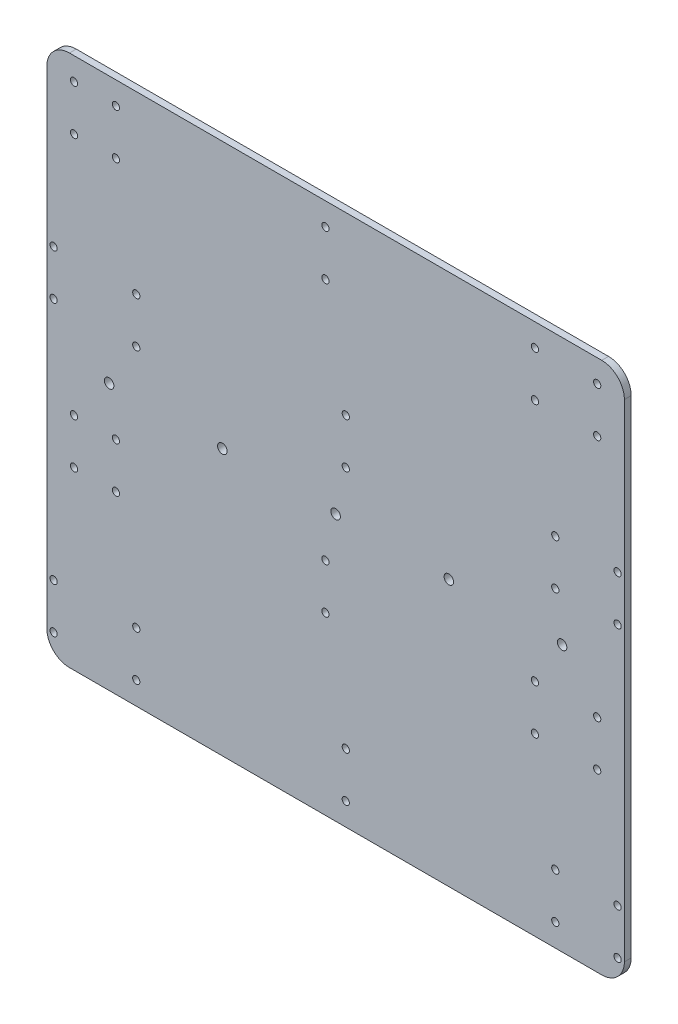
ISO-10303-21;
HEADER;
FILE_DESCRIPTION(('STEP AP214'),'2;1');
FILE_NAME('part.step','',(''),(''),'','','');
FILE_SCHEMA(('AUTOMOTIVE_DESIGN { 1 0 10303 214 1 1 1 1 }'));
ENDSEC;
DATA;
#1=APPLICATION_CONTEXT('core data for automotive mechanical design processes');
#2=APPLICATION_PROTOCOL_DEFINITION('international standard','automotive_design',2000,#1);
#3=PRODUCT_CONTEXT('',#1,'mechanical');
#4=PRODUCT('Part','Part','',(#3));
#5=PRODUCT_RELATED_PRODUCT_CATEGORY('part','',(#4));
#6=PRODUCT_DEFINITION_FORMATION('','',#4);
#7=PRODUCT_DEFINITION_CONTEXT('part definition',#1,'design');
#8=PRODUCT_DEFINITION('design','',#6,#7);
#9=PRODUCT_DEFINITION_SHAPE('','',#8);
#10=(LENGTH_UNIT() NAMED_UNIT(*) SI_UNIT(.MILLI.,.METRE.));
#11=(NAMED_UNIT(*) PLANE_ANGLE_UNIT() SI_UNIT($,.RADIAN.));
#12=(NAMED_UNIT(*) SI_UNIT($,.STERADIAN.) SOLID_ANGLE_UNIT());
#13=UNCERTAINTY_MEASURE_WITH_UNIT(LENGTH_MEASURE(1.E-05),#10,'distance_accuracy_value','');
#14=(GEOMETRIC_REPRESENTATION_CONTEXT(3) GLOBAL_UNCERTAINTY_ASSIGNED_CONTEXT((#13)) GLOBAL_UNIT_ASSIGNED_CONTEXT((#10,
#11,#12)) REPRESENTATION_CONTEXT('',''));
#15=CARTESIAN_POINT('',(0.,0.,0.));
#16=DIRECTION('',(0.,0.,1.));
#17=DIRECTION('',(1.,0.,0.));
#18=AXIS2_PLACEMENT_3D('',#15,#16,#17);
#19=CARTESIAN_POINT('',(0.,0.,3.));
#20=DIRECTION('',(0.,0.,-1.));
#21=DIRECTION('',(-1.,0.,0.));
#22=AXIS2_PLACEMENT_3D('',#19,#20,#21);
#23=PLANE('',#22);
#24=CARTESIAN_POINT('',(175.5,245.,3.));
#25=DIRECTION('',(0.,0.,1.));
#26=DIRECTION('',(1.,0.,0.));
#27=AXIS2_PLACEMENT_3D('',#24,#25,#26);
#28=CIRCLE('',#27,1.59999999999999);
#29=CARTESIAN_POINT('',(177.1,245.,3.));
#30=VERTEX_POINT('',#29);
#31=EDGE_CURVE('E501',#30,#30,#28,.T.);
#32=ORIENTED_EDGE('',*,*,#31,.F.);
#33=EDGE_LOOP('',(#32));
#34=FACE_BOUND('',#33,.T.);
#35=CARTESIAN_POINT('',(83.,224.999999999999,3.));
#36=DIRECTION('',(0.,0.,1.));
#37=DIRECTION('',(1.,0.,0.));
#38=AXIS2_PLACEMENT_3D('',#35,#36,#37);
#39=CIRCLE('',#38,1.59999999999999);
#40=CARTESIAN_POINT('',(84.6,224.999999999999,3.));
#41=VERTEX_POINT('',#40);
#42=EDGE_CURVE('E250',#41,#41,#39,.T.);
#43=ORIENTED_EDGE('',*,*,#42,.F.);
#44=EDGE_LOOP('',(#43));
#45=FACE_BOUND('',#44,.T.);
#46=CARTESIAN_POINT('',(92.,177.499999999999,3.));
#47=DIRECTION('',(0.,0.,1.));
#48=DIRECTION('',(1.,0.,0.));
#49=AXIS2_PLACEMENT_3D('',#46,#47,#48);
#50=CIRCLE('',#49,1.59999999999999);
#51=CARTESIAN_POINT('',(93.6,177.499999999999,3.));
#52=VERTEX_POINT('',#51);
#53=EDGE_CURVE('E258',#52,#52,#50,.T.);
#54=ORIENTED_EDGE('',*,*,#53,.F.);
#55=EDGE_LOOP('',(#54));
#56=FACE_BOUND('',#55,.T.);
#57=CARTESIAN_POINT('',(92.,157.499999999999,3.));
#58=DIRECTION('',(0.,0.,1.));
#59=DIRECTION('',(1.,0.,0.));
#60=AXIS2_PLACEMENT_3D('',#57,#58,#59);
#61=CIRCLE('',#60,1.59999999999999);
#62=CARTESIAN_POINT('',(93.6,157.499999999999,3.));
#63=VERTEX_POINT('',#62);
#64=EDGE_CURVE('E266',#63,#63,#61,.T.);
#65=ORIENTED_EDGE('',*,*,#64,.F.);
#66=EDGE_LOOP('',(#65));
#67=FACE_BOUND('',#66,.T.);
#68=CARTESIAN_POINT('',(91.9999999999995,29.9999999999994,3.));
#69=DIRECTION('',(0.,0.,1.));
#70=DIRECTION('',(1.,0.,0.));
#71=AXIS2_PLACEMENT_3D('',#68,#69,#70);
#72=CIRCLE('',#71,1.59999999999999);
#73=CARTESIAN_POINT('',(93.5999999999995,29.9999999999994,3.));
#74=VERTEX_POINT('',#73);
#75=EDGE_CURVE('E223',#74,#74,#72,.T.);
#76=ORIENTED_EDGE('',*,*,#75,.F.);
#77=EDGE_LOOP('',(#76));
#78=FACE_BOUND('',#77,.T.);
#79=CARTESIAN_POINT('',(91.9999999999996,49.9999999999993,3.));
#80=DIRECTION('',(0.,0.,1.));
#81=DIRECTION('',(1.,0.,0.));
#82=AXIS2_PLACEMENT_3D('',#79,#80,#81);
#83=CIRCLE('',#82,1.59999999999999);
#84=CARTESIAN_POINT('',(93.5999999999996,49.9999999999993,3.));
#85=VERTEX_POINT('',#84);
#86=EDGE_CURVE('E224',#85,#85,#83,.T.);
#87=ORIENTED_EDGE('',*,*,#86,.F.);
#88=EDGE_LOOP('',(#87));
#89=FACE_BOUND('',#88,.T.);
#90=CARTESIAN_POINT('',(83.0000000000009,97.4999999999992,3.));
#91=DIRECTION('',(0.,0.,1.));
#92=DIRECTION('',(1.,0.,0.));
#93=AXIS2_PLACEMENT_3D('',#90,#91,#92);
#94=CIRCLE('',#93,1.59999999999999);
#95=CARTESIAN_POINT('',(84.6000000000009,97.4999999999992,3.));
#96=VERTEX_POINT('',#95);
#97=EDGE_CURVE('E232',#96,#96,#94,.T.);
#98=ORIENTED_EDGE('',*,*,#97,.F.);
#99=EDGE_LOOP('',(#98));
#100=FACE_BOUND('',#99,.T.);
#101=CARTESIAN_POINT('',(83.000000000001,117.499999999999,3.));
#102=DIRECTION('',(0.,0.,1.));
#103=DIRECTION('',(1.,0.,0.));
#104=AXIS2_PLACEMENT_3D('',#101,#102,#103);
#105=CIRCLE('',#104,1.59999999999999);
#106=CARTESIAN_POINT('',(84.600000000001,117.499999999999,3.));
#107=VERTEX_POINT('',#106);
#108=EDGE_CURVE('E240',#107,#107,#105,.T.);
#109=ORIENTED_EDGE('',*,*,#108,.F.);
#110=EDGE_LOOP('',(#109));
#111=FACE_BOUND('',#110,.T.);
#112=CARTESIAN_POINT('',(295.5,225.,3.));
#113=DIRECTION('',(0.,0.,1.));
#114=DIRECTION('',(1.,0.,0.));
#115=AXIS2_PLACEMENT_3D('',#112,#113,#114);
#116=CIRCLE('',#115,1.59999999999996);
#117=CARTESIAN_POINT('',(297.1,225.,3.));
#118=VERTEX_POINT('',#117);
#119=EDGE_CURVE('E438',#118,#118,#116,.T.);
#120=ORIENTED_EDGE('',*,*,#119,.F.);
#121=EDGE_LOOP('',(#120));
#122=FACE_BOUND('',#121,.T.);
#123=CARTESIAN_POINT('',(304.5,177.5,3.));
#124=DIRECTION('',(0.,0.,1.));
#125=DIRECTION('',(1.,0.,0.));
#126=AXIS2_PLACEMENT_3D('',#123,#124,#125);
#127=CIRCLE('',#126,1.60000000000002);
#128=CARTESIAN_POINT('',(306.1,177.5,3.));
#129=VERTEX_POINT('',#128);
#130=EDGE_CURVE('E446',#129,#129,#127,.T.);
#131=ORIENTED_EDGE('',*,*,#130,.F.);
#132=EDGE_LOOP('',(#131));
#133=FACE_BOUND('',#132,.T.);
#134=CARTESIAN_POINT('',(304.5,157.5,3.));
#135=DIRECTION('',(0.,0.,1.));
#136=DIRECTION('',(1.,0.,0.));
#137=AXIS2_PLACEMENT_3D('',#134,#135,#136);
#138=CIRCLE('',#137,1.60000000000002);
#139=CARTESIAN_POINT('',(306.1,157.5,3.));
#140=VERTEX_POINT('',#139);
#141=EDGE_CURVE('E454',#140,#140,#138,.T.);
#142=ORIENTED_EDGE('',*,*,#141,.F.);
#143=EDGE_LOOP('',(#142));
#144=FACE_BOUND('',#143,.T.);
#145=CARTESIAN_POINT('',(304.499999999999,30.,3.));
#146=DIRECTION('',(0.,0.,1.));
#147=DIRECTION('',(1.,0.,0.));
#148=AXIS2_PLACEMENT_3D('',#145,#146,#147);
#149=CIRCLE('',#148,1.59999999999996);
#150=CARTESIAN_POINT('',(306.099999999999,30.,3.));
#151=VERTEX_POINT('',#150);
#152=EDGE_CURVE('E406',#151,#151,#149,.T.);
#153=ORIENTED_EDGE('',*,*,#152,.F.);
#154=EDGE_LOOP('',(#153));
#155=FACE_BOUND('',#154,.T.);
#156=CARTESIAN_POINT('',(304.5,50.,3.));
#157=DIRECTION('',(0.,0.,1.));
#158=DIRECTION('',(1.,0.,0.));
#159=AXIS2_PLACEMENT_3D('',#156,#157,#158);
#160=CIRCLE('',#159,1.59999999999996);
#161=CARTESIAN_POINT('',(306.1,50.,3.));
#162=VERTEX_POINT('',#161);
#163=EDGE_CURVE('E407',#162,#162,#160,.T.);
#164=ORIENTED_EDGE('',*,*,#163,.F.);
#165=EDGE_LOOP('',(#164));
#166=FACE_BOUND('',#165,.T.);
#167=CARTESIAN_POINT('',(295.500000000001,97.4999999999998,3.));
#168=DIRECTION('',(0.,0.,1.));
#169=DIRECTION('',(1.,0.,0.));
#170=AXIS2_PLACEMENT_3D('',#167,#168,#169);
#171=CIRCLE('',#170,1.60000000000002);
#172=CARTESIAN_POINT('',(297.100000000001,97.4999999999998,3.));
#173=VERTEX_POINT('',#172);
#174=EDGE_CURVE('E415',#173,#173,#171,.T.);
#175=ORIENTED_EDGE('',*,*,#174,.F.);
#176=EDGE_LOOP('',(#175));
#177=FACE_BOUND('',#176,.T.);
#178=CARTESIAN_POINT('',(295.500000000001,117.5,3.));
#179=DIRECTION('',(0.,0.,1.));
#180=DIRECTION('',(1.,0.,0.));
#181=AXIS2_PLACEMENT_3D('',#178,#179,#180);
#182=CIRCLE('',#181,1.60000000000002);
#183=CARTESIAN_POINT('',(297.100000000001,117.5,3.));
#184=VERTEX_POINT('',#183);
#185=EDGE_CURVE('E423',#184,#184,#182,.T.);
#186=ORIENTED_EDGE('',*,*,#185,.F.);
#187=EDGE_LOOP('',(#186));
#188=FACE_BOUND('',#187,.T.);
#189=CARTESIAN_POINT('',(64.499999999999,117.5,3.));
#190=DIRECTION('',(0.,0.,1.));
#191=DIRECTION('',(-1.,0.,0.));
#192=AXIS2_PLACEMENT_3D('',#189,#190,#191);
#193=CIRCLE('',#192,1.60000000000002);
#194=CARTESIAN_POINT('',(62.899999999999,117.5,3.));
#195=VERTEX_POINT('',#194);
#196=EDGE_CURVE('E360',#195,#195,#193,.T.);
#197=ORIENTED_EDGE('',*,*,#196,.F.);
#198=EDGE_LOOP('',(#197));
#199=FACE_BOUND('',#198,.T.);
#200=CARTESIAN_POINT('',(175.5,225.,3.));
#201=DIRECTION('',(0.,0.,1.));
#202=DIRECTION('',(1.,0.,0.));
#203=AXIS2_PLACEMENT_3D('',#200,#201,#202);
#204=CIRCLE('',#203,1.59999999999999);
#205=CARTESIAN_POINT('',(177.1,225.,3.));
#206=VERTEX_POINT('',#205);
#207=EDGE_CURVE('E502',#206,#206,#204,.T.);
#208=ORIENTED_EDGE('',*,*,#207,.F.);
#209=EDGE_LOOP('',(#208));
#210=FACE_BOUND('',#209,.T.);
#211=CARTESIAN_POINT('',(184.5,177.5,3.));
#212=DIRECTION('',(0.,0.,1.));
#213=DIRECTION('',(1.,0.,0.));
#214=AXIS2_PLACEMENT_3D('',#211,#212,#213);
#215=CIRCLE('',#214,1.59999999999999);
#216=CARTESIAN_POINT('',(186.1,177.5,3.));
#217=VERTEX_POINT('',#216);
#218=EDGE_CURVE('E510',#217,#217,#215,.T.);
#219=ORIENTED_EDGE('',*,*,#218,.F.);
#220=EDGE_LOOP('',(#219));
#221=FACE_BOUND('',#220,.T.);
#222=CARTESIAN_POINT('',(184.5,157.5,3.));
#223=DIRECTION('',(0.,0.,1.));
#224=DIRECTION('',(1.,0.,0.));
#225=AXIS2_PLACEMENT_3D('',#222,#223,#224);
#226=CIRCLE('',#225,1.59999999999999);
#227=CARTESIAN_POINT('',(186.1,157.5,3.));
#228=VERTEX_POINT('',#227);
#229=EDGE_CURVE('E518',#228,#228,#226,.T.);
#230=ORIENTED_EDGE('',*,*,#229,.F.);
#231=EDGE_LOOP('',(#230));
#232=FACE_BOUND('',#231,.T.);
#233=CARTESIAN_POINT('',(184.499999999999,30.,3.));
#234=DIRECTION('',(0.,0.,1.));
#235=DIRECTION('',(1.,0.,0.));
#236=AXIS2_PLACEMENT_3D('',#233,#234,#235);
#237=CIRCLE('',#236,1.59999999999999);
#238=CARTESIAN_POINT('',(186.099999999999,30.,3.));
#239=VERTEX_POINT('',#238);
#240=EDGE_CURVE('E469',#239,#239,#237,.T.);
#241=ORIENTED_EDGE('',*,*,#240,.F.);
#242=EDGE_LOOP('',(#241));
#243=FACE_BOUND('',#242,.T.);
#244=CARTESIAN_POINT('',(184.5,50.,3.));
#245=DIRECTION('',(0.,0.,1.));
#246=DIRECTION('',(1.,0.,0.));
#247=AXIS2_PLACEMENT_3D('',#244,#245,#246);
#248=CIRCLE('',#247,1.59999999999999);
#249=CARTESIAN_POINT('',(186.1,50.,3.));
#250=VERTEX_POINT('',#249);
#251=EDGE_CURVE('E470',#250,#250,#248,.T.);
#252=ORIENTED_EDGE('',*,*,#251,.F.);
#253=EDGE_LOOP('',(#252));
#254=FACE_BOUND('',#253,.T.);
#255=CARTESIAN_POINT('',(175.500000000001,97.4999999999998,3.));
#256=DIRECTION('',(0.,0.,1.));
#257=DIRECTION('',(1.,0.,0.));
#258=AXIS2_PLACEMENT_3D('',#255,#256,#257);
#259=CIRCLE('',#258,1.59999999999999);
#260=CARTESIAN_POINT('',(177.100000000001,97.4999999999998,3.));
#261=VERTEX_POINT('',#260);
#262=EDGE_CURVE('E478',#261,#261,#259,.T.);
#263=ORIENTED_EDGE('',*,*,#262,.F.);
#264=EDGE_LOOP('',(#263));
#265=FACE_BOUND('',#264,.T.);
#266=CARTESIAN_POINT('',(175.500000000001,117.5,3.));
#267=DIRECTION('',(0.,0.,1.));
#268=DIRECTION('',(1.,0.,0.));
#269=AXIS2_PLACEMENT_3D('',#266,#267,#268);
#270=CIRCLE('',#269,1.59999999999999);
#271=CARTESIAN_POINT('',(177.100000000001,117.5,3.));
#272=VERTEX_POINT('',#271);
#273=EDGE_CURVE('E486',#272,#272,#270,.T.);
#274=ORIENTED_EDGE('',*,*,#273,.F.);
#275=EDGE_LOOP('',(#274));
#276=FACE_BOUND('',#275,.T.);
#277=CARTESIAN_POINT('',(295.5,245.,3.));
#278=DIRECTION('',(0.,0.,1.));
#279=DIRECTION('',(1.,0.,0.));
#280=AXIS2_PLACEMENT_3D('',#277,#278,#279);
#281=CIRCLE('',#280,1.59999999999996);
#282=CARTESIAN_POINT('',(297.1,245.,3.));
#283=VERTEX_POINT('',#282);
#284=EDGE_CURVE('E437',#283,#283,#281,.T.);
#285=ORIENTED_EDGE('',*,*,#284,.F.);
#286=EDGE_LOOP('',(#285));
#287=FACE_BOUND('',#286,.T.);
#288=CARTESIAN_POINT('',(268.,225.,3.));
#289=DIRECTION('',(0.,0.,1.));
#290=DIRECTION('',(1.,0.,0.));
#291=AXIS2_PLACEMENT_3D('',#288,#289,#290);
#292=CIRCLE('',#291,1.59999999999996);
#293=CARTESIAN_POINT('',(269.6,225.,3.));
#294=VERTEX_POINT('',#293);
#295=EDGE_CURVE('E314',#294,#294,#292,.T.);
#296=ORIENTED_EDGE('',*,*,#295,.F.);
#297=EDGE_LOOP('',(#296));
#298=FACE_BOUND('',#297,.T.);
#299=CARTESIAN_POINT('',(277.,177.5,3.));
#300=DIRECTION('',(0.,0.,1.));
#301=DIRECTION('',(1.,0.,0.));
#302=AXIS2_PLACEMENT_3D('',#299,#300,#301);
#303=CIRCLE('',#302,1.59999999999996);
#304=CARTESIAN_POINT('',(278.6,177.5,3.));
#305=VERTEX_POINT('',#304);
#306=EDGE_CURVE('E321',#305,#305,#303,.T.);
#307=ORIENTED_EDGE('',*,*,#306,.F.);
#308=EDGE_LOOP('',(#307));
#309=FACE_BOUND('',#308,.T.);
#310=CARTESIAN_POINT('',(277.,157.5,3.));
#311=DIRECTION('',(0.,0.,1.));
#312=DIRECTION('',(1.,0.,0.));
#313=AXIS2_PLACEMENT_3D('',#310,#311,#312);
#314=CIRCLE('',#313,1.60000000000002);
#315=CARTESIAN_POINT('',(278.6,157.5,3.));
#316=VERTEX_POINT('',#315);
#317=EDGE_CURVE('E328',#316,#316,#314,.T.);
#318=ORIENTED_EDGE('',*,*,#317,.F.);
#319=EDGE_LOOP('',(#318));
#320=FACE_BOUND('',#319,.T.);
#321=CARTESIAN_POINT('',(276.999999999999,30.,3.));
#322=DIRECTION('',(0.,0.,1.));
#323=DIRECTION('',(1.,0.,0.));
#324=AXIS2_PLACEMENT_3D('',#321,#322,#323);
#325=CIRCLE('',#324,1.60000000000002);
#326=CARTESIAN_POINT('',(278.599999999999,30.,3.));
#327=VERTEX_POINT('',#326);
#328=EDGE_CURVE('E281',#327,#327,#325,.T.);
#329=ORIENTED_EDGE('',*,*,#328,.F.);
#330=EDGE_LOOP('',(#329));
#331=FACE_BOUND('',#330,.T.);
#332=CARTESIAN_POINT('',(277.,50.,3.));
#333=DIRECTION('',(0.,0.,1.));
#334=DIRECTION('',(1.,0.,0.));
#335=AXIS2_PLACEMENT_3D('',#332,#333,#334);
#336=CIRCLE('',#335,1.60000000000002);
#337=CARTESIAN_POINT('',(278.6,50.,3.));
#338=VERTEX_POINT('',#337);
#339=EDGE_CURVE('E282',#338,#338,#336,.T.);
#340=ORIENTED_EDGE('',*,*,#339,.F.);
#341=EDGE_LOOP('',(#340));
#342=FACE_BOUND('',#341,.T.);
#343=CARTESIAN_POINT('',(268.000000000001,97.4999999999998,3.));
#344=DIRECTION('',(0.,0.,1.));
#345=DIRECTION('',(1.,0.,0.));
#346=AXIS2_PLACEMENT_3D('',#343,#344,#345);
#347=CIRCLE('',#346,1.60000000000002);
#348=CARTESIAN_POINT('',(269.600000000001,97.4999999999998,3.));
#349=VERTEX_POINT('',#348);
#350=EDGE_CURVE('E290',#349,#349,#347,.T.);
#351=ORIENTED_EDGE('',*,*,#350,.F.);
#352=EDGE_LOOP('',(#351));
#353=FACE_BOUND('',#352,.T.);
#354=CARTESIAN_POINT('',(268.000000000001,117.5,3.));
#355=DIRECTION('',(0.,0.,1.));
#356=DIRECTION('',(1.,0.,0.));
#357=AXIS2_PLACEMENT_3D('',#354,#355,#356);
#358=CIRCLE('',#357,1.59999999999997);
#359=CARTESIAN_POINT('',(269.600000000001,117.5,3.));
#360=VERTEX_POINT('',#359);
#361=EDGE_CURVE('E298',#360,#360,#358,.T.);
#362=ORIENTED_EDGE('',*,*,#361,.F.);
#363=EDGE_LOOP('',(#362));
#364=FACE_BOUND('',#363,.T.);
#365=CARTESIAN_POINT('',(83.,244.999999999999,3.));
#366=DIRECTION('',(0.,0.,1.));
#367=DIRECTION('',(1.,0.,0.));
#368=AXIS2_PLACEMENT_3D('',#365,#366,#367);
#369=CIRCLE('',#368,1.59999999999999);
#370=CARTESIAN_POINT('',(84.6,244.999999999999,3.));
#371=VERTEX_POINT('',#370);
#372=EDGE_CURVE('E249',#371,#371,#369,.T.);
#373=ORIENTED_EDGE('',*,*,#372,.F.);
#374=EDGE_LOOP('',(#373));
#375=FACE_BOUND('',#374,.T.);
#376=CARTESIAN_POINT('',(268.,245.,3.));
#377=DIRECTION('',(0.,0.,1.));
#378=DIRECTION('',(1.,0.,0.));
#379=AXIS2_PLACEMENT_3D('',#376,#377,#378);
#380=CIRCLE('',#379,1.59999999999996);
#381=CARTESIAN_POINT('',(269.6,245.,3.));
#382=VERTEX_POINT('',#381);
#383=EDGE_CURVE('E313',#382,#382,#380,.T.);
#384=ORIENTED_EDGE('',*,*,#383,.F.);
#385=EDGE_LOOP('',(#384));
#386=FACE_BOUND('',#385,.T.);
#387=CARTESIAN_POINT('',(64.5,245.,3.));
#388=DIRECTION('',(0.,0.,1.));
#389=DIRECTION('',(-1.,0.,0.));
#390=AXIS2_PLACEMENT_3D('',#387,#388,#389);
#391=CIRCLE('',#390,1.60000000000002);
#392=CARTESIAN_POINT('',(62.9,245.,3.));
#393=VERTEX_POINT('',#392);
#394=EDGE_CURVE('E391',#393,#393,#391,.T.);
#395=ORIENTED_EDGE('',*,*,#394,.F.);
#396=EDGE_LOOP('',(#395));
#397=FACE_BOUND('',#396,.T.);
#398=CARTESIAN_POINT('',(64.5,225.,3.));
#399=DIRECTION('',(0.,0.,1.));
#400=DIRECTION('',(-1.,0.,0.));
#401=AXIS2_PLACEMENT_3D('',#398,#399,#400);
#402=CIRCLE('',#401,1.60000000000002);
#403=CARTESIAN_POINT('',(62.9,225.,3.));
#404=VERTEX_POINT('',#403);
#405=EDGE_CURVE('E383',#404,#404,#402,.T.);
#406=ORIENTED_EDGE('',*,*,#405,.F.);
#407=EDGE_LOOP('',(#406));
#408=FACE_BOUND('',#407,.T.);
#409=CARTESIAN_POINT('',(55.5,177.5,3.));
#410=DIRECTION('',(0.,0.,1.));
#411=DIRECTION('',(-1.,0.,0.));
#412=AXIS2_PLACEMENT_3D('',#409,#410,#411);
#413=CIRCLE('',#412,1.59999999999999);
#414=CARTESIAN_POINT('',(53.9,177.5,3.));
#415=VERTEX_POINT('',#414);
#416=EDGE_CURVE('E375',#415,#415,#413,.T.);
#417=ORIENTED_EDGE('',*,*,#416,.F.);
#418=EDGE_LOOP('',(#417));
#419=FACE_BOUND('',#418,.T.);
#420=CARTESIAN_POINT('',(64.4999999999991,97.4999999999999,3.));
#421=DIRECTION('',(0.,0.,1.));
#422=DIRECTION('',(-1.,0.,0.));
#423=AXIS2_PLACEMENT_3D('',#420,#421,#422);
#424=CIRCLE('',#423,1.60000000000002);
#425=CARTESIAN_POINT('',(62.8999999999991,97.4999999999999,3.));
#426=VERTEX_POINT('',#425);
#427=EDGE_CURVE('E361',#426,#426,#424,.T.);
#428=ORIENTED_EDGE('',*,*,#427,.F.);
#429=EDGE_LOOP('',(#428));
#430=FACE_BOUND('',#429,.T.);
#431=CARTESIAN_POINT('',(55.5000000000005,49.9999999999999,3.));
#432=DIRECTION('',(0.,0.,1.));
#433=DIRECTION('',(-1.,0.,0.));
#434=AXIS2_PLACEMENT_3D('',#431,#432,#433);
#435=CIRCLE('',#434,1.59999999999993);
#436=CARTESIAN_POINT('',(53.9000000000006,49.9999999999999,3.));
#437=VERTEX_POINT('',#436);
#438=EDGE_CURVE('E342',#437,#437,#435,.T.);
#439=ORIENTED_EDGE('',*,*,#438,.F.);
#440=EDGE_LOOP('',(#439));
#441=FACE_BOUND('',#440,.T.);
#442=CARTESIAN_POINT('',(55.5000000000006,30.,3.));
#443=DIRECTION('',(0.,0.,1.));
#444=DIRECTION('',(-1.,0.,0.));
#445=AXIS2_PLACEMENT_3D('',#442,#443,#444);
#446=CIRCLE('',#445,1.60000000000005);
#447=CARTESIAN_POINT('',(53.9000000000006,30.,3.));
#448=VERTEX_POINT('',#447);
#449=EDGE_CURVE('E343',#448,#448,#446,.T.);
#450=ORIENTED_EDGE('',*,*,#449,.F.);
#451=EDGE_LOOP('',(#450));
#452=FACE_BOUND('',#451,.T.);
#453=CARTESIAN_POINT('',(55.5,157.5,3.));
#454=DIRECTION('',(0.,0.,1.));
#455=DIRECTION('',(-1.,0.,0.));
#456=AXIS2_PLACEMENT_3D('',#453,#454,#455);
#457=CIRCLE('',#456,1.60000000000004);
#458=CARTESIAN_POINT('',(53.9,157.5,3.));
#459=VERTEX_POINT('',#458);
#460=EDGE_CURVE('E351',#459,#459,#457,.T.);
#461=ORIENTED_EDGE('',*,*,#460,.F.);
#462=EDGE_LOOP('',(#461));
#463=FACE_BOUND('',#462,.T.);
#464=CARTESIAN_POINT('',(230.,137.5,3.));
#465=DIRECTION('',(0.,0.,1.));
#466=DIRECTION('',(-1.,0.,0.));
#467=AXIS2_PLACEMENT_3D('',#464,#465,#466);
#468=CIRCLE('',#467,2.09999999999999);
#469=CARTESIAN_POINT('',(227.9,137.5,3.));
#470=VERTEX_POINT('',#469);
#471=EDGE_CURVE('E193',#470,#470,#468,.T.);
#472=ORIENTED_EDGE('',*,*,#471,.F.);
#473=EDGE_LOOP('',(#472));
#474=FACE_BOUND('',#473,.T.);
#475=CARTESIAN_POINT('',(280.,137.500000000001,3.));
#476=DIRECTION('',(0.,0.,1.));
#477=DIRECTION('',(-1.,0.,0.));
#478=AXIS2_PLACEMENT_3D('',#475,#476,#477);
#479=CIRCLE('',#478,2.09999999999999);
#480=CARTESIAN_POINT('',(277.9,137.500000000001,3.));
#481=VERTEX_POINT('',#480);
#482=EDGE_CURVE('E198',#481,#481,#479,.T.);
#483=ORIENTED_EDGE('',*,*,#482,.F.);
#484=EDGE_LOOP('',(#483));
#485=FACE_BOUND('',#484,.T.);
#486=CARTESIAN_POINT('',(80.,137.5,3.));
#487=DIRECTION('',(0.,0.,1.));
#488=DIRECTION('',(1.,0.,0.));
#489=AXIS2_PLACEMENT_3D('',#486,#487,#488);
#490=CIRCLE('',#489,2.1);
#491=CARTESIAN_POINT('',(82.1,137.5,3.));
#492=VERTEX_POINT('',#491);
#493=EDGE_CURVE('E212',#492,#492,#490,.T.);
#494=ORIENTED_EDGE('',*,*,#493,.F.);
#495=EDGE_LOOP('',(#494));
#496=FACE_BOUND('',#495,.T.);
#497=CARTESIAN_POINT('',(130.,137.5,3.));
#498=DIRECTION('',(0.,0.,1.));
#499=DIRECTION('',(1.,0.,0.));
#500=AXIS2_PLACEMENT_3D('',#497,#498,#499);
#501=CIRCLE('',#500,2.09999999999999);
#502=CARTESIAN_POINT('',(132.1,137.5,3.));
#503=VERTEX_POINT('',#502);
#504=EDGE_CURVE('E208',#503,#503,#501,.T.);
#505=ORIENTED_EDGE('',*,*,#504,.F.);
#506=EDGE_LOOP('',(#505));
#507=FACE_BOUND('',#506,.T.);
#508=CARTESIAN_POINT('',(180.,137.5,3.));
#509=DIRECTION('',(0.,0.,1.));
#510=DIRECTION('',(1.,0.,0.));
#511=AXIS2_PLACEMENT_3D('',#508,#509,#510);
#512=CIRCLE('',#511,2.09999999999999);
#513=CARTESIAN_POINT('',(182.1,137.5,3.));
#514=VERTEX_POINT('',#513);
#515=EDGE_CURVE('E203',#514,#514,#512,.T.);
#516=ORIENTED_EDGE('',*,*,#515,.F.);
#517=EDGE_LOOP('',(#516));
#518=FACE_BOUND('',#517,.T.);
#519=DIRECTION('',(-1.,0.,0.));
#520=VECTOR('',#519,1.);
#521=CARTESIAN_POINT('',(52.5,255.,3.));
#522=LINE('',#521,#520);
#523=CARTESIAN_POINT('',(297.5,255.,3.));
#524=VERTEX_POINT('',#523);
#525=CARTESIAN_POINT('',(62.5,255.,3.));
#526=VERTEX_POINT('',#525);
#527=EDGE_CURVE('E110',#524,#526,#522,.T.);
#528=ORIENTED_EDGE('',*,*,#527,.T.);
#529=CARTESIAN_POINT('',(62.5,245.,3.));
#530=DIRECTION('',(0.,0.,-1.));
#531=DIRECTION('',(-1.,0.,0.));
#532=AXIS2_PLACEMENT_3D('',#529,#530,#531);
#533=CIRCLE('',#532,10.);
#534=CARTESIAN_POINT('',(52.5,245.,3.));
#535=VERTEX_POINT('',#534);
#536=EDGE_CURVE('E151',#526,#535,#533,.F.);
#537=ORIENTED_EDGE('',*,*,#536,.T.);
#538=DIRECTION('',(0.,-1.,0.));
#539=VECTOR('',#538,1.);
#540=CARTESIAN_POINT('',(52.5,20.,3.));
#541=LINE('',#540,#539);
#542=CARTESIAN_POINT('',(52.5,30.,3.));
#543=VERTEX_POINT('',#542);
#544=EDGE_CURVE('E130',#535,#543,#541,.T.);
#545=ORIENTED_EDGE('',*,*,#544,.T.);
#546=CARTESIAN_POINT('',(62.5,30.,3.));
#547=DIRECTION('',(0.,0.,-1.));
#548=DIRECTION('',(-1.,0.,0.));
#549=AXIS2_PLACEMENT_3D('',#546,#547,#548);
#550=CIRCLE('',#549,10.);
#551=CARTESIAN_POINT('',(62.5,20.,3.));
#552=VERTEX_POINT('',#551);
#553=EDGE_CURVE('E119',#543,#552,#550,.F.);
#554=ORIENTED_EDGE('',*,*,#553,.T.);
#555=DIRECTION('',(1.,0.,0.));
#556=VECTOR('',#555,1.);
#557=CARTESIAN_POINT('',(52.5,20.,3.));
#558=LINE('',#557,#556);
#559=CARTESIAN_POINT('',(297.5,20.,3.));
#560=VERTEX_POINT('',#559);
#561=EDGE_CURVE('E190',#552,#560,#558,.T.);
#562=ORIENTED_EDGE('',*,*,#561,.T.);
#563=CARTESIAN_POINT('',(297.5,30.,3.));
#564=DIRECTION('',(0.,0.,-1.));
#565=DIRECTION('',(-1.,0.,0.));
#566=AXIS2_PLACEMENT_3D('',#563,#564,#565);
#567=CIRCLE('',#566,10.);
#568=CARTESIAN_POINT('',(307.5,30.,3.));
#569=VERTEX_POINT('',#568);
#570=EDGE_CURVE('E118',#560,#569,#567,.F.);
#571=ORIENTED_EDGE('',*,*,#570,.T.);
#572=DIRECTION('',(0.,1.,0.));
#573=VECTOR('',#572,1.);
#574=CARTESIAN_POINT('',(307.5,20.,3.));
#575=LINE('',#574,#573);
#576=CARTESIAN_POINT('',(307.5,245.,3.));
#577=VERTEX_POINT('',#576);
#578=EDGE_CURVE('E112',#569,#577,#575,.T.);
#579=ORIENTED_EDGE('',*,*,#578,.T.);
#580=CARTESIAN_POINT('',(297.5,245.,3.));
#581=DIRECTION('',(0.,0.,-1.));
#582=DIRECTION('',(-1.,0.,0.));
#583=AXIS2_PLACEMENT_3D('',#580,#581,#582);
#584=CIRCLE('',#583,10.);
#585=EDGE_CURVE('E108',#577,#524,#584,.F.);
#586=ORIENTED_EDGE('',*,*,#585,.T.);
#587=EDGE_LOOP('',(#528,#537,#545,#554,#562,#571,#579,#586));
#588=FACE_BOUND('',#587,.T.);
#589=ADVANCED_FACE('F41',(#34,#45,#56,#67,#78,#89,#100,#111,#122,#133,#144,#155,#166,#177,#188,
#199,#210,#221,#232,#243,#254,#265,#276,#287,#298,#309,#320,#331,#342,#353,#364,#375,#386,#397,
#408,#419,#430,#441,#452,#463,#474,#485,#496,#507,#518,#588),#23,.F.);
#590=CARTESIAN_POINT('',(0.,0.,0.));
#591=DIRECTION('',(0.,0.,-1.));
#592=DIRECTION('',(-1.,0.,0.));
#593=AXIS2_PLACEMENT_3D('',#590,#591,#592);
#594=PLANE('',#593);
#595=CARTESIAN_POINT('',(175.5,245.,0.));
#596=DIRECTION('',(0.,0.,1.));
#597=DIRECTION('',(1.,0.,0.));
#598=AXIS2_PLACEMENT_3D('',#595,#596,#597);
#599=CIRCLE('',#598,1.59999999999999);
#600=CARTESIAN_POINT('',(177.1,245.,0.));
#601=VERTEX_POINT('',#600);
#602=EDGE_CURVE('E529',#601,#601,#599,.T.);
#603=ORIENTED_EDGE('',*,*,#602,.T.);
#604=EDGE_LOOP('',(#603));
#605=FACE_BOUND('',#604,.T.);
#606=CARTESIAN_POINT('',(83.,224.999999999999,0.));
#607=DIRECTION('',(0.,0.,1.));
#608=DIRECTION('',(1.,0.,0.));
#609=AXIS2_PLACEMENT_3D('',#606,#607,#608);
#610=CIRCLE('',#609,1.59999999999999);
#611=CARTESIAN_POINT('',(84.6,224.999999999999,0.));
#612=VERTEX_POINT('',#611);
#613=EDGE_CURVE('E245',#612,#612,#610,.T.);
#614=ORIENTED_EDGE('',*,*,#613,.T.);
#615=EDGE_LOOP('',(#614));
#616=FACE_BOUND('',#615,.T.);
#617=CARTESIAN_POINT('',(92.,177.499999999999,0.));
#618=DIRECTION('',(0.,0.,1.));
#619=DIRECTION('',(1.,0.,0.));
#620=AXIS2_PLACEMENT_3D('',#617,#618,#619);
#621=CIRCLE('',#620,1.59999999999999);
#622=CARTESIAN_POINT('',(93.6,177.499999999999,0.));
#623=VERTEX_POINT('',#622);
#624=EDGE_CURVE('E254',#623,#623,#621,.T.);
#625=ORIENTED_EDGE('',*,*,#624,.T.);
#626=EDGE_LOOP('',(#625));
#627=FACE_BOUND('',#626,.T.);
#628=CARTESIAN_POINT('',(92.,157.499999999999,0.));
#629=DIRECTION('',(0.,0.,1.));
#630=DIRECTION('',(1.,0.,0.));
#631=AXIS2_PLACEMENT_3D('',#628,#629,#630);
#632=CIRCLE('',#631,1.59999999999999);
#633=CARTESIAN_POINT('',(93.6,157.499999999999,0.));
#634=VERTEX_POINT('',#633);
#635=EDGE_CURVE('E262',#634,#634,#632,.T.);
#636=ORIENTED_EDGE('',*,*,#635,.T.);
#637=EDGE_LOOP('',(#636));
#638=FACE_BOUND('',#637,.T.);
#639=CARTESIAN_POINT('',(91.9999999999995,29.9999999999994,0.));
#640=DIRECTION('',(0.,0.,1.));
#641=DIRECTION('',(1.,0.,0.));
#642=AXIS2_PLACEMENT_3D('',#639,#640,#641);
#643=CIRCLE('',#642,1.59999999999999);
#644=CARTESIAN_POINT('',(93.5999999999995,29.9999999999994,0.));
#645=VERTEX_POINT('',#644);
#646=EDGE_CURVE('E270',#645,#645,#643,.T.);
#647=ORIENTED_EDGE('',*,*,#646,.T.);
#648=EDGE_LOOP('',(#647));
#649=FACE_BOUND('',#648,.T.);
#650=CARTESIAN_POINT('',(91.9999999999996,49.9999999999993,0.));
#651=DIRECTION('',(0.,0.,1.));
#652=DIRECTION('',(1.,0.,0.));
#653=AXIS2_PLACEMENT_3D('',#650,#651,#652);
#654=CIRCLE('',#653,1.59999999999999);
#655=CARTESIAN_POINT('',(93.5999999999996,49.9999999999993,0.));
#656=VERTEX_POINT('',#655);
#657=EDGE_CURVE('E219',#656,#656,#654,.T.);
#658=ORIENTED_EDGE('',*,*,#657,.T.);
#659=EDGE_LOOP('',(#658));
#660=FACE_BOUND('',#659,.T.);
#661=CARTESIAN_POINT('',(83.0000000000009,97.4999999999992,0.));
#662=DIRECTION('',(0.,0.,1.));
#663=DIRECTION('',(1.,0.,0.));
#664=AXIS2_PLACEMENT_3D('',#661,#662,#663);
#665=CIRCLE('',#664,1.59999999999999);
#666=CARTESIAN_POINT('',(84.6000000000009,97.4999999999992,0.));
#667=VERTEX_POINT('',#666);
#668=EDGE_CURVE('E228',#667,#667,#665,.T.);
#669=ORIENTED_EDGE('',*,*,#668,.T.);
#670=EDGE_LOOP('',(#669));
#671=FACE_BOUND('',#670,.T.);
#672=CARTESIAN_POINT('',(83.000000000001,117.499999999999,0.));
#673=DIRECTION('',(0.,0.,1.));
#674=DIRECTION('',(1.,0.,0.));
#675=AXIS2_PLACEMENT_3D('',#672,#673,#674);
#676=CIRCLE('',#675,1.59999999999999);
#677=CARTESIAN_POINT('',(84.600000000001,117.499999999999,0.));
#678=VERTEX_POINT('',#677);
#679=EDGE_CURVE('E236',#678,#678,#676,.T.);
#680=ORIENTED_EDGE('',*,*,#679,.T.);
#681=EDGE_LOOP('',(#680));
#682=FACE_BOUND('',#681,.T.);
#683=CARTESIAN_POINT('',(295.5,225.,0.));
#684=DIRECTION('',(0.,0.,1.));
#685=DIRECTION('',(1.,0.,0.));
#686=AXIS2_PLACEMENT_3D('',#683,#684,#685);
#687=CIRCLE('',#686,1.59999999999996);
#688=CARTESIAN_POINT('',(297.1,225.,0.));
#689=VERTEX_POINT('',#688);
#690=EDGE_CURVE('E434',#689,#689,#687,.T.);
#691=ORIENTED_EDGE('',*,*,#690,.T.);
#692=EDGE_LOOP('',(#691));
#693=FACE_BOUND('',#692,.T.);
#694=CARTESIAN_POINT('',(304.5,177.5,0.));
#695=DIRECTION('',(0.,0.,1.));
#696=DIRECTION('',(1.,0.,0.));
#697=AXIS2_PLACEMENT_3D('',#694,#695,#696);
#698=CIRCLE('',#697,1.60000000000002);
#699=CARTESIAN_POINT('',(306.1,177.5,0.));
#700=VERTEX_POINT('',#699);
#701=EDGE_CURVE('E442',#700,#700,#698,.T.);
#702=ORIENTED_EDGE('',*,*,#701,.T.);
#703=EDGE_LOOP('',(#702));
#704=FACE_BOUND('',#703,.T.);
#705=CARTESIAN_POINT('',(304.5,157.5,0.));
#706=DIRECTION('',(0.,0.,1.));
#707=DIRECTION('',(1.,0.,0.));
#708=AXIS2_PLACEMENT_3D('',#705,#706,#707);
#709=CIRCLE('',#708,1.60000000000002);
#710=CARTESIAN_POINT('',(306.1,157.5,0.));
#711=VERTEX_POINT('',#710);
#712=EDGE_CURVE('E450',#711,#711,#709,.T.);
#713=ORIENTED_EDGE('',*,*,#712,.T.);
#714=EDGE_LOOP('',(#713));
#715=FACE_BOUND('',#714,.T.);
#716=CARTESIAN_POINT('',(304.499999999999,30.,0.));
#717=DIRECTION('',(0.,0.,1.));
#718=DIRECTION('',(1.,0.,0.));
#719=AXIS2_PLACEMENT_3D('',#716,#717,#718);
#720=CIRCLE('',#719,1.59999999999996);
#721=CARTESIAN_POINT('',(306.099999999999,30.,0.));
#722=VERTEX_POINT('',#721);
#723=EDGE_CURVE('E458',#722,#722,#720,.T.);
#724=ORIENTED_EDGE('',*,*,#723,.T.);
#725=EDGE_LOOP('',(#724));
#726=FACE_BOUND('',#725,.T.);
#727=CARTESIAN_POINT('',(304.5,50.,0.));
#728=DIRECTION('',(0.,0.,1.));
#729=DIRECTION('',(1.,0.,0.));
#730=AXIS2_PLACEMENT_3D('',#727,#728,#729);
#731=CIRCLE('',#730,1.59999999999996);
#732=CARTESIAN_POINT('',(306.1,50.,0.));
#733=VERTEX_POINT('',#732);
#734=EDGE_CURVE('E402',#733,#733,#731,.T.);
#735=ORIENTED_EDGE('',*,*,#734,.T.);
#736=EDGE_LOOP('',(#735));
#737=FACE_BOUND('',#736,.T.);
#738=CARTESIAN_POINT('',(295.500000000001,97.4999999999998,0.));
#739=DIRECTION('',(0.,0.,1.));
#740=DIRECTION('',(1.,0.,0.));
#741=AXIS2_PLACEMENT_3D('',#738,#739,#740);
#742=CIRCLE('',#741,1.60000000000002);
#743=CARTESIAN_POINT('',(297.100000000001,97.4999999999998,0.));
#744=VERTEX_POINT('',#743);
#745=EDGE_CURVE('E411',#744,#744,#742,.T.);
#746=ORIENTED_EDGE('',*,*,#745,.T.);
#747=EDGE_LOOP('',(#746));
#748=FACE_BOUND('',#747,.T.);
#749=CARTESIAN_POINT('',(295.500000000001,117.5,0.));
#750=DIRECTION('',(0.,0.,1.));
#751=DIRECTION('',(1.,0.,0.));
#752=AXIS2_PLACEMENT_3D('',#749,#750,#751);
#753=CIRCLE('',#752,1.60000000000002);
#754=CARTESIAN_POINT('',(297.100000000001,117.5,0.));
#755=VERTEX_POINT('',#754);
#756=EDGE_CURVE('E419',#755,#755,#753,.T.);
#757=ORIENTED_EDGE('',*,*,#756,.T.);
#758=EDGE_LOOP('',(#757));
#759=FACE_BOUND('',#758,.T.);
#760=CARTESIAN_POINT('',(64.499999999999,117.5,0.));
#761=DIRECTION('',(0.,0.,1.));
#762=DIRECTION('',(-1.,0.,0.));
#763=AXIS2_PLACEMENT_3D('',#760,#761,#762);
#764=CIRCLE('',#763,1.60000000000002);
#765=CARTESIAN_POINT('',(62.899999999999,117.5,0.));
#766=VERTEX_POINT('',#765);
#767=EDGE_CURVE('E427',#766,#766,#764,.T.);
#768=ORIENTED_EDGE('',*,*,#767,.T.);
#769=EDGE_LOOP('',(#768));
#770=FACE_BOUND('',#769,.T.);
#771=CARTESIAN_POINT('',(175.5,225.,0.));
#772=DIRECTION('',(0.,0.,1.));
#773=DIRECTION('',(1.,0.,0.));
#774=AXIS2_PLACEMENT_3D('',#771,#772,#773);
#775=CIRCLE('',#774,1.59999999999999);
#776=CARTESIAN_POINT('',(177.1,225.,0.));
#777=VERTEX_POINT('',#776);
#778=EDGE_CURVE('E497',#777,#777,#775,.T.);
#779=ORIENTED_EDGE('',*,*,#778,.T.);
#780=EDGE_LOOP('',(#779));
#781=FACE_BOUND('',#780,.T.);
#782=CARTESIAN_POINT('',(184.5,177.5,0.));
#783=DIRECTION('',(0.,0.,1.));
#784=DIRECTION('',(1.,0.,0.));
#785=AXIS2_PLACEMENT_3D('',#782,#783,#784);
#786=CIRCLE('',#785,1.59999999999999);
#787=CARTESIAN_POINT('',(186.1,177.5,0.));
#788=VERTEX_POINT('',#787);
#789=EDGE_CURVE('E506',#788,#788,#786,.T.);
#790=ORIENTED_EDGE('',*,*,#789,.T.);
#791=EDGE_LOOP('',(#790));
#792=FACE_BOUND('',#791,.T.);
#793=CARTESIAN_POINT('',(184.5,157.5,0.));
#794=DIRECTION('',(0.,0.,1.));
#795=DIRECTION('',(1.,0.,0.));
#796=AXIS2_PLACEMENT_3D('',#793,#794,#795);
#797=CIRCLE('',#796,1.59999999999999);
#798=CARTESIAN_POINT('',(186.1,157.5,0.));
#799=VERTEX_POINT('',#798);
#800=EDGE_CURVE('E514',#799,#799,#797,.T.);
#801=ORIENTED_EDGE('',*,*,#800,.T.);
#802=EDGE_LOOP('',(#801));
#803=FACE_BOUND('',#802,.T.);
#804=CARTESIAN_POINT('',(184.499999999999,30.,0.));
#805=DIRECTION('',(0.,0.,1.));
#806=DIRECTION('',(1.,0.,0.));
#807=AXIS2_PLACEMENT_3D('',#804,#805,#806);
#808=CIRCLE('',#807,1.59999999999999);
#809=CARTESIAN_POINT('',(186.099999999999,30.,0.));
#810=VERTEX_POINT('',#809);
#811=EDGE_CURVE('E522',#810,#810,#808,.T.);
#812=ORIENTED_EDGE('',*,*,#811,.T.);
#813=EDGE_LOOP('',(#812));
#814=FACE_BOUND('',#813,.T.);
#815=CARTESIAN_POINT('',(184.5,50.,0.));
#816=DIRECTION('',(0.,0.,1.));
#817=DIRECTION('',(1.,0.,0.));
#818=AXIS2_PLACEMENT_3D('',#815,#816,#817);
#819=CIRCLE('',#818,1.59999999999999);
#820=CARTESIAN_POINT('',(186.1,50.,0.));
#821=VERTEX_POINT('',#820);
#822=EDGE_CURVE('E465',#821,#821,#819,.T.);
#823=ORIENTED_EDGE('',*,*,#822,.T.);
#824=EDGE_LOOP('',(#823));
#825=FACE_BOUND('',#824,.T.);
#826=CARTESIAN_POINT('',(175.500000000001,97.4999999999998,0.));
#827=DIRECTION('',(0.,0.,1.));
#828=DIRECTION('',(1.,0.,0.));
#829=AXIS2_PLACEMENT_3D('',#826,#827,#828);
#830=CIRCLE('',#829,1.59999999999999);
#831=CARTESIAN_POINT('',(177.100000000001,97.4999999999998,0.));
#832=VERTEX_POINT('',#831);
#833=EDGE_CURVE('E474',#832,#832,#830,.T.);
#834=ORIENTED_EDGE('',*,*,#833,.T.);
#835=EDGE_LOOP('',(#834));
#836=FACE_BOUND('',#835,.T.);
#837=CARTESIAN_POINT('',(175.500000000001,117.5,0.));
#838=DIRECTION('',(0.,0.,1.));
#839=DIRECTION('',(1.,0.,0.));
#840=AXIS2_PLACEMENT_3D('',#837,#838,#839);
#841=CIRCLE('',#840,1.59999999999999);
#842=CARTESIAN_POINT('',(177.100000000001,117.5,0.));
#843=VERTEX_POINT('',#842);
#844=EDGE_CURVE('E482',#843,#843,#841,.T.);
#845=ORIENTED_EDGE('',*,*,#844,.T.);
#846=EDGE_LOOP('',(#845));
#847=FACE_BOUND('',#846,.T.);
#848=CARTESIAN_POINT('',(295.5,245.,0.));
#849=DIRECTION('',(0.,0.,1.));
#850=DIRECTION('',(1.,0.,0.));
#851=AXIS2_PLACEMENT_3D('',#848,#849,#850);
#852=CIRCLE('',#851,1.59999999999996);
#853=CARTESIAN_POINT('',(297.1,245.,0.));
#854=VERTEX_POINT('',#853);
#855=EDGE_CURVE('E490',#854,#854,#852,.T.);
#856=ORIENTED_EDGE('',*,*,#855,.T.);
#857=EDGE_LOOP('',(#856));
#858=FACE_BOUND('',#857,.T.);
#859=CARTESIAN_POINT('',(268.,225.,0.));
#860=DIRECTION('',(0.,0.,1.));
#861=DIRECTION('',(1.,0.,0.));
#862=AXIS2_PLACEMENT_3D('',#859,#860,#861);
#863=CIRCLE('',#862,1.59999999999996);
#864=CARTESIAN_POINT('',(269.6,225.,0.));
#865=VERTEX_POINT('',#864);
#866=EDGE_CURVE('E309',#865,#865,#863,.T.);
#867=ORIENTED_EDGE('',*,*,#866,.T.);
#868=EDGE_LOOP('',(#867));
#869=FACE_BOUND('',#868,.T.);
#870=CARTESIAN_POINT('',(277.,177.5,0.));
#871=DIRECTION('',(0.,0.,1.));
#872=DIRECTION('',(1.,0.,0.));
#873=AXIS2_PLACEMENT_3D('',#870,#871,#872);
#874=CIRCLE('',#873,1.59999999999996);
#875=CARTESIAN_POINT('',(278.6,177.5,0.));
#876=VERTEX_POINT('',#875);
#877=EDGE_CURVE('E317',#876,#876,#874,.T.);
#878=ORIENTED_EDGE('',*,*,#877,.T.);
#879=EDGE_LOOP('',(#878));
#880=FACE_BOUND('',#879,.T.);
#881=CARTESIAN_POINT('',(277.,157.5,0.));
#882=DIRECTION('',(0.,0.,1.));
#883=DIRECTION('',(1.,0.,0.));
#884=AXIS2_PLACEMENT_3D('',#881,#882,#883);
#885=CIRCLE('',#884,1.60000000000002);
#886=CARTESIAN_POINT('',(278.6,157.5,0.));
#887=VERTEX_POINT('',#886);
#888=EDGE_CURVE('E324',#887,#887,#885,.T.);
#889=ORIENTED_EDGE('',*,*,#888,.T.);
#890=EDGE_LOOP('',(#889));
#891=FACE_BOUND('',#890,.T.);
#892=CARTESIAN_POINT('',(276.999999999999,30.,0.));
#893=DIRECTION('',(0.,0.,1.));
#894=DIRECTION('',(1.,0.,0.));
#895=AXIS2_PLACEMENT_3D('',#892,#893,#894);
#896=CIRCLE('',#895,1.60000000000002);
#897=CARTESIAN_POINT('',(278.599999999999,30.,0.));
#898=VERTEX_POINT('',#897);
#899=EDGE_CURVE('E331',#898,#898,#896,.T.);
#900=ORIENTED_EDGE('',*,*,#899,.T.);
#901=EDGE_LOOP('',(#900));
#902=FACE_BOUND('',#901,.T.);
#903=CARTESIAN_POINT('',(277.,50.,0.));
#904=DIRECTION('',(0.,0.,1.));
#905=DIRECTION('',(1.,0.,0.));
#906=AXIS2_PLACEMENT_3D('',#903,#904,#905);
#907=CIRCLE('',#906,1.60000000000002);
#908=CARTESIAN_POINT('',(278.6,50.,0.));
#909=VERTEX_POINT('',#908);
#910=EDGE_CURVE('E277',#909,#909,#907,.T.);
#911=ORIENTED_EDGE('',*,*,#910,.T.);
#912=EDGE_LOOP('',(#911));
#913=FACE_BOUND('',#912,.T.);
#914=CARTESIAN_POINT('',(268.000000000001,97.4999999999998,0.));
#915=DIRECTION('',(0.,0.,1.));
#916=DIRECTION('',(1.,0.,0.));
#917=AXIS2_PLACEMENT_3D('',#914,#915,#916);
#918=CIRCLE('',#917,1.60000000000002);
#919=CARTESIAN_POINT('',(269.600000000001,97.4999999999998,0.));
#920=VERTEX_POINT('',#919);
#921=EDGE_CURVE('E286',#920,#920,#918,.T.);
#922=ORIENTED_EDGE('',*,*,#921,.T.);
#923=EDGE_LOOP('',(#922));
#924=FACE_BOUND('',#923,.T.);
#925=CARTESIAN_POINT('',(268.000000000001,117.5,0.));
#926=DIRECTION('',(0.,0.,1.));
#927=DIRECTION('',(1.,0.,0.));
#928=AXIS2_PLACEMENT_3D('',#925,#926,#927);
#929=CIRCLE('',#928,1.59999999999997);
#930=CARTESIAN_POINT('',(269.600000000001,117.5,0.));
#931=VERTEX_POINT('',#930);
#932=EDGE_CURVE('E294',#931,#931,#929,.T.);
#933=ORIENTED_EDGE('',*,*,#932,.T.);
#934=EDGE_LOOP('',(#933));
#935=FACE_BOUND('',#934,.T.);
#936=CARTESIAN_POINT('',(83.,244.999999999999,0.));
#937=DIRECTION('',(0.,0.,1.));
#938=DIRECTION('',(1.,0.,0.));
#939=AXIS2_PLACEMENT_3D('',#936,#937,#938);
#940=CIRCLE('',#939,1.59999999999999);
#941=CARTESIAN_POINT('',(84.6,244.999999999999,0.));
#942=VERTEX_POINT('',#941);
#943=EDGE_CURVE('E302',#942,#942,#940,.T.);
#944=ORIENTED_EDGE('',*,*,#943,.T.);
#945=EDGE_LOOP('',(#944));
#946=FACE_BOUND('',#945,.T.);
#947=CARTESIAN_POINT('',(268.,245.,0.));
#948=DIRECTION('',(0.,0.,1.));
#949=DIRECTION('',(1.,0.,0.));
#950=AXIS2_PLACEMENT_3D('',#947,#948,#949);
#951=CIRCLE('',#950,1.59999999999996);
#952=CARTESIAN_POINT('',(269.6,245.,0.));
#953=VERTEX_POINT('',#952);
#954=EDGE_CURVE('E395',#953,#953,#951,.T.);
#955=ORIENTED_EDGE('',*,*,#954,.T.);
#956=EDGE_LOOP('',(#955));
#957=FACE_BOUND('',#956,.T.);
#958=CARTESIAN_POINT('',(64.5,245.,0.));
#959=DIRECTION('',(0.,0.,1.));
#960=DIRECTION('',(-1.,0.,0.));
#961=AXIS2_PLACEMENT_3D('',#958,#959,#960);
#962=CIRCLE('',#961,1.60000000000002);
#963=CARTESIAN_POINT('',(62.9,245.,0.));
#964=VERTEX_POINT('',#963);
#965=EDGE_CURVE('E387',#964,#964,#962,.T.);
#966=ORIENTED_EDGE('',*,*,#965,.T.);
#967=EDGE_LOOP('',(#966));
#968=FACE_BOUND('',#967,.T.);
#969=CARTESIAN_POINT('',(64.5,225.,0.));
#970=DIRECTION('',(0.,0.,1.));
#971=DIRECTION('',(-1.,0.,0.));
#972=AXIS2_PLACEMENT_3D('',#969,#970,#971);
#973=CIRCLE('',#972,1.60000000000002);
#974=CARTESIAN_POINT('',(62.9,225.,0.));
#975=VERTEX_POINT('',#974);
#976=EDGE_CURVE('E379',#975,#975,#973,.T.);
#977=ORIENTED_EDGE('',*,*,#976,.T.);
#978=EDGE_LOOP('',(#977));
#979=FACE_BOUND('',#978,.T.);
#980=CARTESIAN_POINT('',(55.5,177.5,0.));
#981=DIRECTION('',(0.,0.,1.));
#982=DIRECTION('',(-1.,0.,0.));
#983=AXIS2_PLACEMENT_3D('',#980,#981,#982);
#984=CIRCLE('',#983,1.59999999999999);
#985=CARTESIAN_POINT('',(53.9,177.5,0.));
#986=VERTEX_POINT('',#985);
#987=EDGE_CURVE('E355',#986,#986,#984,.T.);
#988=ORIENTED_EDGE('',*,*,#987,.T.);
#989=EDGE_LOOP('',(#988));
#990=FACE_BOUND('',#989,.T.);
#991=CARTESIAN_POINT('',(64.4999999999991,97.4999999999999,0.));
#992=DIRECTION('',(0.,0.,1.));
#993=DIRECTION('',(-1.,0.,0.));
#994=AXIS2_PLACEMENT_3D('',#991,#992,#993);
#995=CIRCLE('',#994,1.60000000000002);
#996=CARTESIAN_POINT('',(62.8999999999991,97.4999999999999,0.));
#997=VERTEX_POINT('',#996);
#998=EDGE_CURVE('E356',#997,#997,#995,.T.);
#999=ORIENTED_EDGE('',*,*,#998,.T.);
#1000=EDGE_LOOP('',(#999));
#1001=FACE_BOUND('',#1000,.T.);
#1002=CARTESIAN_POINT('',(55.5000000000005,49.9999999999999,0.));
#1003=DIRECTION('',(0.,0.,1.));
#1004=DIRECTION('',(-1.,0.,0.));
#1005=AXIS2_PLACEMENT_3D('',#1002,#1003,#1004);
#1006=CIRCLE('',#1005,1.59999999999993);
#1007=CARTESIAN_POINT('',(53.9000000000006,49.9999999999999,0.));
#1008=VERTEX_POINT('',#1007);
#1009=EDGE_CURVE('E365',#1008,#1008,#1006,.T.);
#1010=ORIENTED_EDGE('',*,*,#1009,.T.);
#1011=EDGE_LOOP('',(#1010));
#1012=FACE_BOUND('',#1011,.T.);
#1013=CARTESIAN_POINT('',(55.5000000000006,30.,0.));
#1014=DIRECTION('',(0.,0.,1.));
#1015=DIRECTION('',(-1.,0.,0.));
#1016=AXIS2_PLACEMENT_3D('',#1013,#1014,#1015);
#1017=CIRCLE('',#1016,1.60000000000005);
#1018=CARTESIAN_POINT('',(53.9000000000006,30.,0.));
#1019=VERTEX_POINT('',#1018);
#1020=EDGE_CURVE('E338',#1019,#1019,#1017,.T.);
#1021=ORIENTED_EDGE('',*,*,#1020,.T.);
#1022=EDGE_LOOP('',(#1021));
#1023=FACE_BOUND('',#1022,.T.);
#1024=CARTESIAN_POINT('',(55.5,157.5,0.));
#1025=DIRECTION('',(0.,0.,1.));
#1026=DIRECTION('',(-1.,0.,0.));
#1027=AXIS2_PLACEMENT_3D('',#1024,#1025,#1026);
#1028=CIRCLE('',#1027,1.60000000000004);
#1029=CARTESIAN_POINT('',(53.9,157.5,0.));
#1030=VERTEX_POINT('',#1029);
#1031=EDGE_CURVE('E347',#1030,#1030,#1028,.T.);
#1032=ORIENTED_EDGE('',*,*,#1031,.T.);
#1033=EDGE_LOOP('',(#1032));
#1034=FACE_BOUND('',#1033,.T.);
#1035=CARTESIAN_POINT('',(230.,137.5,0.));
#1036=DIRECTION('',(0.,0.,-1.));
#1037=DIRECTION('',(-1.,0.,0.));
#1038=AXIS2_PLACEMENT_3D('',#1035,#1036,#1037);
#1039=CIRCLE('',#1038,2.09999999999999);
#1040=CARTESIAN_POINT('',(227.9,137.5,0.));
#1041=VERTEX_POINT('',#1040);
#1042=EDGE_CURVE('E207',#1041,#1041,#1039,.T.);
#1043=ORIENTED_EDGE('',*,*,#1042,.F.);
#1044=EDGE_LOOP('',(#1043));
#1045=FACE_BOUND('',#1044,.T.);
#1046=CARTESIAN_POINT('',(280.,137.500000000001,0.));
#1047=DIRECTION('',(0.,0.,-1.));
#1048=DIRECTION('',(-1.,0.,0.));
#1049=AXIS2_PLACEMENT_3D('',#1046,#1047,#1048);
#1050=CIRCLE('',#1049,2.09999999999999);
#1051=CARTESIAN_POINT('',(277.9,137.500000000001,0.));
#1052=VERTEX_POINT('',#1051);
#1053=EDGE_CURVE('E540',#1052,#1052,#1050,.T.);
#1054=ORIENTED_EDGE('',*,*,#1053,.F.);
#1055=EDGE_LOOP('',(#1054));
#1056=FACE_BOUND('',#1055,.T.);
#1057=CARTESIAN_POINT('',(80.,137.5,0.));
#1058=DIRECTION('',(0.,0.,-1.));
#1059=DIRECTION('',(-1.,0.,0.));
#1060=AXIS2_PLACEMENT_3D('',#1057,#1058,#1059);
#1061=CIRCLE('',#1060,2.1);
#1062=CARTESIAN_POINT('',(77.9,137.5,0.));
#1063=VERTEX_POINT('',#1062);
#1064=EDGE_CURVE('E544',#1063,#1063,#1061,.T.);
#1065=ORIENTED_EDGE('',*,*,#1064,.F.);
#1066=EDGE_LOOP('',(#1065));
#1067=FACE_BOUND('',#1066,.T.);
#1068=CARTESIAN_POINT('',(130.,137.5,0.));
#1069=DIRECTION('',(0.,0.,-1.));
#1070=DIRECTION('',(-1.,0.,0.));
#1071=AXIS2_PLACEMENT_3D('',#1068,#1069,#1070);
#1072=CIRCLE('',#1071,2.09999999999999);
#1073=CARTESIAN_POINT('',(127.9,137.5,0.));
#1074=VERTEX_POINT('',#1073);
#1075=EDGE_CURVE('E547',#1074,#1074,#1072,.T.);
#1076=ORIENTED_EDGE('',*,*,#1075,.F.);
#1077=EDGE_LOOP('',(#1076));
#1078=FACE_BOUND('',#1077,.T.);
#1079=CARTESIAN_POINT('',(180.,137.5,0.));
#1080=DIRECTION('',(0.,0.,-1.));
#1081=DIRECTION('',(-1.,0.,0.));
#1082=AXIS2_PLACEMENT_3D('',#1079,#1080,#1081);
#1083=CIRCLE('',#1082,2.09999999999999);
#1084=CARTESIAN_POINT('',(177.9,137.5,0.));
#1085=VERTEX_POINT('',#1084);
#1086=EDGE_CURVE('E244',#1085,#1085,#1083,.T.);
#1087=ORIENTED_EDGE('',*,*,#1086,.F.);
#1088=EDGE_LOOP('',(#1087));
#1089=FACE_BOUND('',#1088,.T.);
#1090=DIRECTION('',(0.,1.,0.));
#1091=VECTOR('',#1090,1.);
#1092=CARTESIAN_POINT('',(52.5,0.,0.));
#1093=LINE('',#1092,#1091);
#1094=CARTESIAN_POINT('',(52.5,30.,0.));
#1095=VERTEX_POINT('',#1094);
#1096=CARTESIAN_POINT('',(52.5,245.,0.));
#1097=VERTEX_POINT('',#1096);
#1098=EDGE_CURVE('E556',#1095,#1097,#1093,.T.);
#1099=ORIENTED_EDGE('',*,*,#1098,.T.);
#1100=CARTESIAN_POINT('',(62.5,245.,0.));
#1101=DIRECTION('',(0.,0.,-1.));
#1102=DIRECTION('',(-1.,0.,0.));
#1103=AXIS2_PLACEMENT_3D('',#1100,#1101,#1102);
#1104=CIRCLE('',#1103,10.);
#1105=CARTESIAN_POINT('',(62.5,255.,0.));
#1106=VERTEX_POINT('',#1105);
#1107=EDGE_CURVE('E168',#1097,#1106,#1104,.T.);
#1108=ORIENTED_EDGE('',*,*,#1107,.T.);
#1109=DIRECTION('',(1.,0.,0.));
#1110=VECTOR('',#1109,1.);
#1111=CARTESIAN_POINT('',(0.,255.,0.));
#1112=LINE('',#1111,#1110);
#1113=CARTESIAN_POINT('',(297.5,255.,0.));
#1114=VERTEX_POINT('',#1113);
#1115=EDGE_CURVE('E533',#1106,#1114,#1112,.T.);
#1116=ORIENTED_EDGE('',*,*,#1115,.T.);
#1117=CARTESIAN_POINT('',(297.5,245.,0.));
#1118=DIRECTION('',(0.,0.,-1.));
#1119=DIRECTION('',(-1.,0.,0.));
#1120=AXIS2_PLACEMENT_3D('',#1117,#1118,#1119);
#1121=CIRCLE('',#1120,10.);
#1122=CARTESIAN_POINT('',(307.5,245.,0.));
#1123=VERTEX_POINT('',#1122);
#1124=EDGE_CURVE('E134',#1114,#1123,#1121,.T.);
#1125=ORIENTED_EDGE('',*,*,#1124,.T.);
#1126=DIRECTION('',(0.,-1.,0.));
#1127=VECTOR('',#1126,1.);
#1128=CARTESIAN_POINT('',(307.5,0.,0.));
#1129=LINE('',#1128,#1127);
#1130=CARTESIAN_POINT('',(307.5,30.,0.));
#1131=VERTEX_POINT('',#1130);
#1132=EDGE_CURVE('E136',#1123,#1131,#1129,.T.);
#1133=ORIENTED_EDGE('',*,*,#1132,.T.);
#1134=CARTESIAN_POINT('',(297.5,30.,0.));
#1135=DIRECTION('',(0.,0.,-1.));
#1136=DIRECTION('',(-1.,0.,0.));
#1137=AXIS2_PLACEMENT_3D('',#1134,#1135,#1136);
#1138=CIRCLE('',#1137,10.);
#1139=CARTESIAN_POINT('',(297.5,20.,0.));
#1140=VERTEX_POINT('',#1139);
#1141=EDGE_CURVE('E64',#1131,#1140,#1138,.T.);
#1142=ORIENTED_EDGE('',*,*,#1141,.T.);
#1143=DIRECTION('',(-1.,0.,0.));
#1144=VECTOR('',#1143,1.);
#1145=CARTESIAN_POINT('',(0.,20.,0.));
#1146=LINE('',#1145,#1144);
#1147=CARTESIAN_POINT('',(62.5,20.,0.));
#1148=VERTEX_POINT('',#1147);
#1149=EDGE_CURVE('E143',#1140,#1148,#1146,.T.);
#1150=ORIENTED_EDGE('',*,*,#1149,.T.);
#1151=CARTESIAN_POINT('',(62.5,30.,0.));
#1152=DIRECTION('',(0.,0.,-1.));
#1153=DIRECTION('',(-1.,0.,0.));
#1154=AXIS2_PLACEMENT_3D('',#1151,#1152,#1153);
#1155=CIRCLE('',#1154,10.);
#1156=EDGE_CURVE('E161',#1148,#1095,#1155,.T.);
#1157=ORIENTED_EDGE('',*,*,#1156,.T.);
#1158=EDGE_LOOP('',(#1099,#1108,#1116,#1125,#1133,#1142,#1150,#1157));
#1159=FACE_BOUND('',#1158,.T.);
#1160=ADVANCED_FACE('F184',(#605,#616,#627,#638,#649,#660,#671,#682,#693,#704,#715,#726,#737,
#748,#759,#770,#781,#792,#803,#814,#825,#836,#847,#858,#869,#880,#891,#902,#913,#924,#935,#946,
#957,#968,#979,#990,#1001,#1012,#1023,#1034,#1045,#1056,#1067,#1078,#1089,#1159),#594,.T.);
#1161=CARTESIAN_POINT('',(175.5,245.,0.));
#1162=DIRECTION('',(0.,0.,1.));
#1163=DIRECTION('',(1.,0.,0.));
#1164=AXIS2_PLACEMENT_3D('',#1161,#1162,#1163);
#1165=CYLINDRICAL_SURFACE('',#1164,1.59999999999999);
#1166=ORIENTED_EDGE('',*,*,#602,.F.);
#1167=EDGE_LOOP('',(#1166));
#1168=FACE_BOUND('',#1167,.T.);
#1169=ORIENTED_EDGE('',*,*,#31,.T.);
#1170=EDGE_LOOP('',(#1169));
#1171=FACE_BOUND('',#1170,.T.);
#1172=ADVANCED_FACE('F585',(#1168,#1171),#1165,.F.);
#1173=CARTESIAN_POINT('',(83.,224.999999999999,0.));
#1174=DIRECTION('',(0.,0.,1.));
#1175=DIRECTION('',(1.,0.,0.));
#1176=AXIS2_PLACEMENT_3D('',#1173,#1174,#1175);
#1177=CYLINDRICAL_SURFACE('',#1176,1.59999999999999);
#1178=ORIENTED_EDGE('',*,*,#613,.F.);
#1179=EDGE_LOOP('',(#1178));
#1180=FACE_BOUND('',#1179,.T.);
#1181=ORIENTED_EDGE('',*,*,#42,.T.);
#1182=EDGE_LOOP('',(#1181));
#1183=FACE_BOUND('',#1182,.T.);
#1184=ADVANCED_FACE('F592',(#1180,#1183),#1177,.F.);
#1185=CARTESIAN_POINT('',(92.,177.499999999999,0.));
#1186=DIRECTION('',(0.,0.,1.));
#1187=DIRECTION('',(1.,0.,0.));
#1188=AXIS2_PLACEMENT_3D('',#1185,#1186,#1187);
#1189=CYLINDRICAL_SURFACE('',#1188,1.59999999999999);
#1190=ORIENTED_EDGE('',*,*,#624,.F.);
#1191=EDGE_LOOP('',(#1190));
#1192=FACE_BOUND('',#1191,.T.);
#1193=ORIENTED_EDGE('',*,*,#53,.T.);
#1194=EDGE_LOOP('',(#1193));
#1195=FACE_BOUND('',#1194,.T.);
#1196=ADVANCED_FACE('F732',(#1192,#1195),#1189,.F.);
#1197=CARTESIAN_POINT('',(92.,157.499999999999,0.));
#1198=DIRECTION('',(0.,0.,1.));
#1199=DIRECTION('',(1.,0.,0.));
#1200=AXIS2_PLACEMENT_3D('',#1197,#1198,#1199);
#1201=CYLINDRICAL_SURFACE('',#1200,1.59999999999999);
#1202=ORIENTED_EDGE('',*,*,#635,.F.);
#1203=EDGE_LOOP('',(#1202));
#1204=FACE_BOUND('',#1203,.T.);
#1205=ORIENTED_EDGE('',*,*,#64,.T.);
#1206=EDGE_LOOP('',(#1205));
#1207=FACE_BOUND('',#1206,.T.);
#1208=ADVANCED_FACE('F728',(#1204,#1207),#1201,.F.);
#1209=CARTESIAN_POINT('',(91.9999999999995,29.9999999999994,0.));
#1210=DIRECTION('',(0.,0.,1.));
#1211=DIRECTION('',(1.,0.,0.));
#1212=AXIS2_PLACEMENT_3D('',#1209,#1210,#1211);
#1213=CYLINDRICAL_SURFACE('',#1212,1.59999999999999);
#1214=ORIENTED_EDGE('',*,*,#646,.F.);
#1215=EDGE_LOOP('',(#1214));
#1216=FACE_BOUND('',#1215,.T.);
#1217=ORIENTED_EDGE('',*,*,#75,.T.);
#1218=EDGE_LOOP('',(#1217));
#1219=FACE_BOUND('',#1218,.T.);
#1220=ADVANCED_FACE('F724',(#1216,#1219),#1213,.F.);
#1221=CARTESIAN_POINT('',(91.9999999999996,49.9999999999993,0.));
#1222=DIRECTION('',(0.,0.,1.));
#1223=DIRECTION('',(1.,0.,0.));
#1224=AXIS2_PLACEMENT_3D('',#1221,#1222,#1223);
#1225=CYLINDRICAL_SURFACE('',#1224,1.59999999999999);
#1226=ORIENTED_EDGE('',*,*,#657,.F.);
#1227=EDGE_LOOP('',(#1226));
#1228=FACE_BOUND('',#1227,.T.);
#1229=ORIENTED_EDGE('',*,*,#86,.T.);
#1230=EDGE_LOOP('',(#1229));
#1231=FACE_BOUND('',#1230,.T.);
#1232=ADVANCED_FACE('F727',(#1228,#1231),#1225,.F.);
#1233=CARTESIAN_POINT('',(83.0000000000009,97.4999999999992,0.));
#1234=DIRECTION('',(0.,0.,1.));
#1235=DIRECTION('',(1.,0.,0.));
#1236=AXIS2_PLACEMENT_3D('',#1233,#1234,#1235);
#1237=CYLINDRICAL_SURFACE('',#1236,1.59999999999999);
#1238=ORIENTED_EDGE('',*,*,#668,.F.);
#1239=EDGE_LOOP('',(#1238));
#1240=FACE_BOUND('',#1239,.T.);
#1241=ORIENTED_EDGE('',*,*,#97,.T.);
#1242=EDGE_LOOP('',(#1241));
#1243=FACE_BOUND('',#1242,.T.);
#1244=ADVANCED_FACE('F742',(#1240,#1243),#1237,.F.);
#1245=CARTESIAN_POINT('',(83.000000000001,117.499999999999,0.));
#1246=DIRECTION('',(0.,0.,1.));
#1247=DIRECTION('',(1.,0.,0.));
#1248=AXIS2_PLACEMENT_3D('',#1245,#1246,#1247);
#1249=CYLINDRICAL_SURFACE('',#1248,1.59999999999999);
#1250=ORIENTED_EDGE('',*,*,#679,.F.);
#1251=EDGE_LOOP('',(#1250));
#1252=FACE_BOUND('',#1251,.T.);
#1253=ORIENTED_EDGE('',*,*,#108,.T.);
#1254=EDGE_LOOP('',(#1253));
#1255=FACE_BOUND('',#1254,.T.);
#1256=ADVANCED_FACE('F644',(#1252,#1255),#1249,.F.);
#1257=CARTESIAN_POINT('',(295.5,225.,0.));
#1258=DIRECTION('',(0.,0.,1.));
#1259=DIRECTION('',(1.,0.,0.));
#1260=AXIS2_PLACEMENT_3D('',#1257,#1258,#1259);
#1261=CYLINDRICAL_SURFACE('',#1260,1.59999999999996);
#1262=ORIENTED_EDGE('',*,*,#690,.F.);
#1263=EDGE_LOOP('',(#1262));
#1264=FACE_BOUND('',#1263,.T.);
#1265=ORIENTED_EDGE('',*,*,#119,.T.);
#1266=EDGE_LOOP('',(#1265));
#1267=FACE_BOUND('',#1266,.T.);
#1268=ADVANCED_FACE('F640',(#1264,#1267),#1261,.F.);
#1269=CARTESIAN_POINT('',(304.5,177.5,0.));
#1270=DIRECTION('',(0.,0.,1.));
#1271=DIRECTION('',(1.,0.,0.));
#1272=AXIS2_PLACEMENT_3D('',#1269,#1270,#1271);
#1273=CYLINDRICAL_SURFACE('',#1272,1.60000000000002);
#1274=ORIENTED_EDGE('',*,*,#701,.F.);
#1275=EDGE_LOOP('',(#1274));
#1276=FACE_BOUND('',#1275,.T.);
#1277=ORIENTED_EDGE('',*,*,#130,.T.);
#1278=EDGE_LOOP('',(#1277));
#1279=FACE_BOUND('',#1278,.T.);
#1280=ADVANCED_FACE('F636',(#1276,#1279),#1273,.F.);
#1281=CARTESIAN_POINT('',(304.5,157.5,0.));
#1282=DIRECTION('',(0.,0.,1.));
#1283=DIRECTION('',(1.,0.,0.));
#1284=AXIS2_PLACEMENT_3D('',#1281,#1282,#1283);
#1285=CYLINDRICAL_SURFACE('',#1284,1.60000000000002);
#1286=ORIENTED_EDGE('',*,*,#712,.F.);
#1287=EDGE_LOOP('',(#1286));
#1288=FACE_BOUND('',#1287,.T.);
#1289=ORIENTED_EDGE('',*,*,#141,.T.);
#1290=EDGE_LOOP('',(#1289));
#1291=FACE_BOUND('',#1290,.T.);
#1292=ADVANCED_FACE('F632',(#1288,#1291),#1285,.F.);
#1293=CARTESIAN_POINT('',(304.499999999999,30.,0.));
#1294=DIRECTION('',(0.,0.,1.));
#1295=DIRECTION('',(1.,0.,0.));
#1296=AXIS2_PLACEMENT_3D('',#1293,#1294,#1295);
#1297=CYLINDRICAL_SURFACE('',#1296,1.59999999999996);
#1298=ORIENTED_EDGE('',*,*,#723,.F.);
#1299=EDGE_LOOP('',(#1298));
#1300=FACE_BOUND('',#1299,.T.);
#1301=ORIENTED_EDGE('',*,*,#152,.T.);
#1302=EDGE_LOOP('',(#1301));
#1303=FACE_BOUND('',#1302,.T.);
#1304=ADVANCED_FACE('F628',(#1300,#1303),#1297,.F.);
#1305=CARTESIAN_POINT('',(304.5,50.,0.));
#1306=DIRECTION('',(0.,0.,1.));
#1307=DIRECTION('',(1.,0.,0.));
#1308=AXIS2_PLACEMENT_3D('',#1305,#1306,#1307);
#1309=CYLINDRICAL_SURFACE('',#1308,1.59999999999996);
#1310=ORIENTED_EDGE('',*,*,#734,.F.);
#1311=EDGE_LOOP('',(#1310));
#1312=FACE_BOUND('',#1311,.T.);
#1313=ORIENTED_EDGE('',*,*,#163,.T.);
#1314=EDGE_LOOP('',(#1313));
#1315=FACE_BOUND('',#1314,.T.);
#1316=ADVANCED_FACE('F631',(#1312,#1315),#1309,.F.);
#1317=CARTESIAN_POINT('',(295.500000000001,97.4999999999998,0.));
#1318=DIRECTION('',(0.,0.,1.));
#1319=DIRECTION('',(1.,0.,0.));
#1320=AXIS2_PLACEMENT_3D('',#1317,#1318,#1319);
#1321=CYLINDRICAL_SURFACE('',#1320,1.60000000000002);
#1322=ORIENTED_EDGE('',*,*,#745,.F.);
#1323=EDGE_LOOP('',(#1322));
#1324=FACE_BOUND('',#1323,.T.);
#1325=ORIENTED_EDGE('',*,*,#174,.T.);
#1326=EDGE_LOOP('',(#1325));
#1327=FACE_BOUND('',#1326,.T.);
#1328=ADVANCED_FACE('F652',(#1324,#1327),#1321,.F.);
#1329=CARTESIAN_POINT('',(295.500000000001,117.5,0.));
#1330=DIRECTION('',(0.,0.,1.));
#1331=DIRECTION('',(1.,0.,0.));
#1332=AXIS2_PLACEMENT_3D('',#1329,#1330,#1331);
#1333=CYLINDRICAL_SURFACE('',#1332,1.60000000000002);
#1334=ORIENTED_EDGE('',*,*,#756,.F.);
#1335=EDGE_LOOP('',(#1334));
#1336=FACE_BOUND('',#1335,.T.);
#1337=ORIENTED_EDGE('',*,*,#185,.T.);
#1338=EDGE_LOOP('',(#1337));
#1339=FACE_BOUND('',#1338,.T.);
#1340=ADVANCED_FACE('F648',(#1336,#1339),#1333,.F.);
#1341=CARTESIAN_POINT('',(64.499999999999,117.5,0.));
#1342=DIRECTION('',(0.,0.,1.));
#1343=DIRECTION('',(1.,0.,0.));
#1344=AXIS2_PLACEMENT_3D('',#1341,#1342,#1343);
#1345=CYLINDRICAL_SURFACE('',#1344,1.60000000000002);
#1346=ORIENTED_EDGE('',*,*,#767,.F.);
#1347=EDGE_LOOP('',(#1346));
#1348=FACE_BOUND('',#1347,.T.);
#1349=ORIENTED_EDGE('',*,*,#196,.T.);
#1350=EDGE_LOOP('',(#1349));
#1351=FACE_BOUND('',#1350,.T.);
#1352=ADVANCED_FACE('F610',(#1348,#1351),#1345,.F.);
#1353=CARTESIAN_POINT('',(175.5,225.,0.));
#1354=DIRECTION('',(0.,0.,1.));
#1355=DIRECTION('',(1.,0.,0.));
#1356=AXIS2_PLACEMENT_3D('',#1353,#1354,#1355);
#1357=CYLINDRICAL_SURFACE('',#1356,1.59999999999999);
#1358=ORIENTED_EDGE('',*,*,#778,.F.);
#1359=EDGE_LOOP('',(#1358));
#1360=FACE_BOUND('',#1359,.T.);
#1361=ORIENTED_EDGE('',*,*,#207,.T.);
#1362=EDGE_LOOP('',(#1361));
#1363=FACE_BOUND('',#1362,.T.);
#1364=ADVANCED_FACE('F606',(#1360,#1363),#1357,.F.);
#1365=CARTESIAN_POINT('',(184.5,177.5,0.));
#1366=DIRECTION('',(0.,0.,1.));
#1367=DIRECTION('',(1.,0.,0.));
#1368=AXIS2_PLACEMENT_3D('',#1365,#1366,#1367);
#1369=CYLINDRICAL_SURFACE('',#1368,1.59999999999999);
#1370=ORIENTED_EDGE('',*,*,#789,.F.);
#1371=EDGE_LOOP('',(#1370));
#1372=FACE_BOUND('',#1371,.T.);
#1373=ORIENTED_EDGE('',*,*,#218,.T.);
#1374=EDGE_LOOP('',(#1373));
#1375=FACE_BOUND('',#1374,.T.);
#1376=ADVANCED_FACE('F602',(#1372,#1375),#1369,.F.);
#1377=CARTESIAN_POINT('',(184.5,157.5,0.));
#1378=DIRECTION('',(0.,0.,1.));
#1379=DIRECTION('',(1.,0.,0.));
#1380=AXIS2_PLACEMENT_3D('',#1377,#1378,#1379);
#1381=CYLINDRICAL_SURFACE('',#1380,1.59999999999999);
#1382=ORIENTED_EDGE('',*,*,#800,.F.);
#1383=EDGE_LOOP('',(#1382));
#1384=FACE_BOUND('',#1383,.T.);
#1385=ORIENTED_EDGE('',*,*,#229,.T.);
#1386=EDGE_LOOP('',(#1385));
#1387=FACE_BOUND('',#1386,.T.);
#1388=ADVANCED_FACE('F598',(#1384,#1387),#1381,.F.);
#1389=CARTESIAN_POINT('',(184.499999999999,30.,0.));
#1390=DIRECTION('',(0.,0.,1.));
#1391=DIRECTION('',(1.,0.,0.));
#1392=AXIS2_PLACEMENT_3D('',#1389,#1390,#1391);
#1393=CYLINDRICAL_SURFACE('',#1392,1.59999999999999);
#1394=ORIENTED_EDGE('',*,*,#811,.F.);
#1395=EDGE_LOOP('',(#1394));
#1396=FACE_BOUND('',#1395,.T.);
#1397=ORIENTED_EDGE('',*,*,#240,.T.);
#1398=EDGE_LOOP('',(#1397));
#1399=FACE_BOUND('',#1398,.T.);
#1400=ADVANCED_FACE('F594',(#1396,#1399),#1393,.F.);
#1401=CARTESIAN_POINT('',(184.5,50.,0.));
#1402=DIRECTION('',(0.,0.,1.));
#1403=DIRECTION('',(1.,0.,0.));
#1404=AXIS2_PLACEMENT_3D('',#1401,#1402,#1403);
#1405=CYLINDRICAL_SURFACE('',#1404,1.59999999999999);
#1406=ORIENTED_EDGE('',*,*,#822,.F.);
#1407=EDGE_LOOP('',(#1406));
#1408=FACE_BOUND('',#1407,.T.);
#1409=ORIENTED_EDGE('',*,*,#251,.T.);
#1410=EDGE_LOOP('',(#1409));
#1411=FACE_BOUND('',#1410,.T.);
#1412=ADVANCED_FACE('F597',(#1408,#1411),#1405,.F.);
#1413=CARTESIAN_POINT('',(175.500000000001,97.4999999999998,0.));
#1414=DIRECTION('',(0.,0.,1.));
#1415=DIRECTION('',(1.,0.,0.));
#1416=AXIS2_PLACEMENT_3D('',#1413,#1414,#1415);
#1417=CYLINDRICAL_SURFACE('',#1416,1.59999999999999);
#1418=ORIENTED_EDGE('',*,*,#833,.F.);
#1419=EDGE_LOOP('',(#1418));
#1420=FACE_BOUND('',#1419,.T.);
#1421=ORIENTED_EDGE('',*,*,#262,.T.);
#1422=EDGE_LOOP('',(#1421));
#1423=FACE_BOUND('',#1422,.T.);
#1424=ADVANCED_FACE('F620',(#1420,#1423),#1417,.F.);
#1425=CARTESIAN_POINT('',(175.500000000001,117.5,0.));
#1426=DIRECTION('',(0.,0.,1.));
#1427=DIRECTION('',(1.,0.,0.));
#1428=AXIS2_PLACEMENT_3D('',#1425,#1426,#1427);
#1429=CYLINDRICAL_SURFACE('',#1428,1.59999999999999);
#1430=ORIENTED_EDGE('',*,*,#844,.F.);
#1431=EDGE_LOOP('',(#1430));
#1432=FACE_BOUND('',#1431,.T.);
#1433=ORIENTED_EDGE('',*,*,#273,.T.);
#1434=EDGE_LOOP('',(#1433));
#1435=FACE_BOUND('',#1434,.T.);
#1436=ADVANCED_FACE('F616',(#1432,#1435),#1429,.F.);
#1437=CARTESIAN_POINT('',(295.5,245.,0.));
#1438=DIRECTION('',(0.,0.,1.));
#1439=DIRECTION('',(1.,0.,0.));
#1440=AXIS2_PLACEMENT_3D('',#1437,#1438,#1439);
#1441=CYLINDRICAL_SURFACE('',#1440,1.59999999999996);
#1442=ORIENTED_EDGE('',*,*,#855,.F.);
#1443=EDGE_LOOP('',(#1442));
#1444=FACE_BOUND('',#1443,.T.);
#1445=ORIENTED_EDGE('',*,*,#284,.T.);
#1446=EDGE_LOOP('',(#1445));
#1447=FACE_BOUND('',#1446,.T.);
#1448=ADVANCED_FACE('F612',(#1444,#1447),#1441,.F.);
#1449=CARTESIAN_POINT('',(268.,225.,0.));
#1450=DIRECTION('',(0.,0.,1.));
#1451=DIRECTION('',(1.,0.,0.));
#1452=AXIS2_PLACEMENT_3D('',#1449,#1450,#1451);
#1453=CYLINDRICAL_SURFACE('',#1452,1.59999999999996);
#1454=ORIENTED_EDGE('',*,*,#866,.F.);
#1455=EDGE_LOOP('',(#1454));
#1456=FACE_BOUND('',#1455,.T.);
#1457=ORIENTED_EDGE('',*,*,#295,.T.);
#1458=EDGE_LOOP('',(#1457));
#1459=FACE_BOUND('',#1458,.T.);
#1460=ADVANCED_FACE('F615',(#1456,#1459),#1453,.F.);
#1461=CARTESIAN_POINT('',(277.,177.5,0.));
#1462=DIRECTION('',(0.,0.,1.));
#1463=DIRECTION('',(1.,0.,0.));
#1464=AXIS2_PLACEMENT_3D('',#1461,#1462,#1463);
#1465=CYLINDRICAL_SURFACE('',#1464,1.59999999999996);
#1466=ORIENTED_EDGE('',*,*,#877,.F.);
#1467=EDGE_LOOP('',(#1466));
#1468=FACE_BOUND('',#1467,.T.);
#1469=ORIENTED_EDGE('',*,*,#306,.T.);
#1470=EDGE_LOOP('',(#1469));
#1471=FACE_BOUND('',#1470,.T.);
#1472=ADVANCED_FACE('F702',(#1468,#1471),#1465,.F.);
#1473=CARTESIAN_POINT('',(277.,157.5,0.));
#1474=DIRECTION('',(0.,0.,1.));
#1475=DIRECTION('',(1.,0.,0.));
#1476=AXIS2_PLACEMENT_3D('',#1473,#1474,#1475);
#1477=CYLINDRICAL_SURFACE('',#1476,1.60000000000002);
#1478=ORIENTED_EDGE('',*,*,#888,.F.);
#1479=EDGE_LOOP('',(#1478));
#1480=FACE_BOUND('',#1479,.T.);
#1481=ORIENTED_EDGE('',*,*,#317,.T.);
#1482=EDGE_LOOP('',(#1481));
#1483=FACE_BOUND('',#1482,.T.);
#1484=ADVANCED_FACE('F698',(#1480,#1483),#1477,.F.);
#1485=CARTESIAN_POINT('',(276.999999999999,30.,0.));
#1486=DIRECTION('',(0.,0.,1.));
#1487=DIRECTION('',(1.,0.,0.));
#1488=AXIS2_PLACEMENT_3D('',#1485,#1486,#1487);
#1489=CYLINDRICAL_SURFACE('',#1488,1.60000000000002);
#1490=ORIENTED_EDGE('',*,*,#899,.F.);
#1491=EDGE_LOOP('',(#1490));
#1492=FACE_BOUND('',#1491,.T.);
#1493=ORIENTED_EDGE('',*,*,#328,.T.);
#1494=EDGE_LOOP('',(#1493));
#1495=FACE_BOUND('',#1494,.T.);
#1496=ADVANCED_FACE('F694',(#1492,#1495),#1489,.F.);
#1497=CARTESIAN_POINT('',(277.,50.,0.));
#1498=DIRECTION('',(0.,0.,1.));
#1499=DIRECTION('',(1.,0.,0.));
#1500=AXIS2_PLACEMENT_3D('',#1497,#1498,#1499);
#1501=CYLINDRICAL_SURFACE('',#1500,1.60000000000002);
#1502=ORIENTED_EDGE('',*,*,#910,.F.);
#1503=EDGE_LOOP('',(#1502));
#1504=FACE_BOUND('',#1503,.T.);
#1505=ORIENTED_EDGE('',*,*,#339,.T.);
#1506=EDGE_LOOP('',(#1505));
#1507=FACE_BOUND('',#1506,.T.);
#1508=ADVANCED_FACE('F697',(#1504,#1507),#1501,.F.);
#1509=CARTESIAN_POINT('',(268.000000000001,97.4999999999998,0.));
#1510=DIRECTION('',(0.,0.,1.));
#1511=DIRECTION('',(1.,0.,0.));
#1512=AXIS2_PLACEMENT_3D('',#1509,#1510,#1511);
#1513=CYLINDRICAL_SURFACE('',#1512,1.60000000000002);
#1514=ORIENTED_EDGE('',*,*,#921,.F.);
#1515=EDGE_LOOP('',(#1514));
#1516=FACE_BOUND('',#1515,.T.);
#1517=ORIENTED_EDGE('',*,*,#350,.T.);
#1518=EDGE_LOOP('',(#1517));
#1519=FACE_BOUND('',#1518,.T.);
#1520=ADVANCED_FACE('F716',(#1516,#1519),#1513,.F.);
#1521=CARTESIAN_POINT('',(268.000000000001,117.5,0.));
#1522=DIRECTION('',(0.,0.,1.));
#1523=DIRECTION('',(1.,0.,0.));
#1524=AXIS2_PLACEMENT_3D('',#1521,#1522,#1523);
#1525=CYLINDRICAL_SURFACE('',#1524,1.59999999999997);
#1526=ORIENTED_EDGE('',*,*,#932,.F.);
#1527=EDGE_LOOP('',(#1526));
#1528=FACE_BOUND('',#1527,.T.);
#1529=ORIENTED_EDGE('',*,*,#361,.T.);
#1530=EDGE_LOOP('',(#1529));
#1531=FACE_BOUND('',#1530,.T.);
#1532=ADVANCED_FACE('F712',(#1528,#1531),#1525,.F.);
#1533=CARTESIAN_POINT('',(83.,244.999999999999,0.));
#1534=DIRECTION('',(0.,0.,1.));
#1535=DIRECTION('',(1.,0.,0.));
#1536=AXIS2_PLACEMENT_3D('',#1533,#1534,#1535);
#1537=CYLINDRICAL_SURFACE('',#1536,1.59999999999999);
#1538=ORIENTED_EDGE('',*,*,#943,.F.);
#1539=EDGE_LOOP('',(#1538));
#1540=FACE_BOUND('',#1539,.T.);
#1541=ORIENTED_EDGE('',*,*,#372,.T.);
#1542=EDGE_LOOP('',(#1541));
#1543=FACE_BOUND('',#1542,.T.);
#1544=ADVANCED_FACE('F664',(#1540,#1543),#1537,.F.);
#1545=CARTESIAN_POINT('',(268.,245.,0.));
#1546=DIRECTION('',(0.,0.,1.));
#1547=DIRECTION('',(1.,0.,0.));
#1548=AXIS2_PLACEMENT_3D('',#1545,#1546,#1547);
#1549=CYLINDRICAL_SURFACE('',#1548,1.59999999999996);
#1550=ORIENTED_EDGE('',*,*,#954,.F.);
#1551=EDGE_LOOP('',(#1550));
#1552=FACE_BOUND('',#1551,.T.);
#1553=ORIENTED_EDGE('',*,*,#383,.T.);
#1554=EDGE_LOOP('',(#1553));
#1555=FACE_BOUND('',#1554,.T.);
#1556=ADVANCED_FACE('F660',(#1552,#1555),#1549,.F.);
#1557=CARTESIAN_POINT('',(64.5,245.,0.));
#1558=DIRECTION('',(0.,0.,1.));
#1559=DIRECTION('',(1.,0.,0.));
#1560=AXIS2_PLACEMENT_3D('',#1557,#1558,#1559);
#1561=CYLINDRICAL_SURFACE('',#1560,1.60000000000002);
#1562=ORIENTED_EDGE('',*,*,#965,.F.);
#1563=EDGE_LOOP('',(#1562));
#1564=FACE_BOUND('',#1563,.T.);
#1565=ORIENTED_EDGE('',*,*,#394,.T.);
#1566=EDGE_LOOP('',(#1565));
#1567=FACE_BOUND('',#1566,.T.);
#1568=ADVANCED_FACE('F663',(#1564,#1567),#1561,.F.);
#1569=CARTESIAN_POINT('',(64.5,225.,0.));
#1570=DIRECTION('',(0.,0.,1.));
#1571=DIRECTION('',(1.,0.,0.));
#1572=AXIS2_PLACEMENT_3D('',#1569,#1570,#1571);
#1573=CYLINDRICAL_SURFACE('',#1572,1.60000000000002);
#1574=ORIENTED_EDGE('',*,*,#976,.F.);
#1575=EDGE_LOOP('',(#1574));
#1576=FACE_BOUND('',#1575,.T.);
#1577=ORIENTED_EDGE('',*,*,#405,.T.);
#1578=EDGE_LOOP('',(#1577));
#1579=FACE_BOUND('',#1578,.T.);
#1580=ADVANCED_FACE('F668',(#1576,#1579),#1573,.F.);
#1581=CARTESIAN_POINT('',(55.5,177.5,0.));
#1582=DIRECTION('',(0.,0.,1.));
#1583=DIRECTION('',(1.,0.,0.));
#1584=AXIS2_PLACEMENT_3D('',#1581,#1582,#1583);
#1585=CYLINDRICAL_SURFACE('',#1584,1.59999999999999);
#1586=ORIENTED_EDGE('',*,*,#987,.F.);
#1587=EDGE_LOOP('',(#1586));
#1588=FACE_BOUND('',#1587,.T.);
#1589=ORIENTED_EDGE('',*,*,#416,.T.);
#1590=EDGE_LOOP('',(#1589));
#1591=FACE_BOUND('',#1590,.T.);
#1592=ADVANCED_FACE('F672',(#1588,#1591),#1585,.F.);
#1593=CARTESIAN_POINT('',(64.4999999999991,97.4999999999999,0.));
#1594=DIRECTION('',(0.,0.,1.));
#1595=DIRECTION('',(1.,0.,0.));
#1596=AXIS2_PLACEMENT_3D('',#1593,#1594,#1595);
#1597=CYLINDRICAL_SURFACE('',#1596,1.60000000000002);
#1598=ORIENTED_EDGE('',*,*,#998,.F.);
#1599=EDGE_LOOP('',(#1598));
#1600=FACE_BOUND('',#1599,.T.);
#1601=ORIENTED_EDGE('',*,*,#427,.T.);
#1602=EDGE_LOOP('',(#1601));
#1603=FACE_BOUND('',#1602,.T.);
#1604=ADVANCED_FACE('F676',(#1600,#1603),#1597,.F.);
#1605=CARTESIAN_POINT('',(55.5000000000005,49.9999999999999,0.));
#1606=DIRECTION('',(0.,0.,1.));
#1607=DIRECTION('',(1.,0.,0.));
#1608=AXIS2_PLACEMENT_3D('',#1605,#1606,#1607);
#1609=CYLINDRICAL_SURFACE('',#1608,1.59999999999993);
#1610=ORIENTED_EDGE('',*,*,#1009,.F.);
#1611=EDGE_LOOP('',(#1610));
#1612=FACE_BOUND('',#1611,.T.);
#1613=ORIENTED_EDGE('',*,*,#438,.T.);
#1614=EDGE_LOOP('',(#1613));
#1615=FACE_BOUND('',#1614,.T.);
#1616=ADVANCED_FACE('F678',(#1612,#1615),#1609,.F.);
#1617=CARTESIAN_POINT('',(55.5000000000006,30.,0.));
#1618=DIRECTION('',(0.,0.,1.));
#1619=DIRECTION('',(1.,0.,0.));
#1620=AXIS2_PLACEMENT_3D('',#1617,#1618,#1619);
#1621=CYLINDRICAL_SURFACE('',#1620,1.60000000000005);
#1622=ORIENTED_EDGE('',*,*,#1020,.F.);
#1623=EDGE_LOOP('',(#1622));
#1624=FACE_BOUND('',#1623,.T.);
#1625=ORIENTED_EDGE('',*,*,#449,.T.);
#1626=EDGE_LOOP('',(#1625));
#1627=FACE_BOUND('',#1626,.T.);
#1628=ADVANCED_FACE('F681',(#1624,#1627),#1621,.F.);
#1629=CARTESIAN_POINT('',(55.5,157.5,0.));
#1630=DIRECTION('',(0.,0.,1.));
#1631=DIRECTION('',(1.,0.,0.));
#1632=AXIS2_PLACEMENT_3D('',#1629,#1630,#1631);
#1633=CYLINDRICAL_SURFACE('',#1632,1.60000000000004);
#1634=ORIENTED_EDGE('',*,*,#1031,.F.);
#1635=EDGE_LOOP('',(#1634));
#1636=FACE_BOUND('',#1635,.T.);
#1637=ORIENTED_EDGE('',*,*,#460,.T.);
#1638=EDGE_LOOP('',(#1637));
#1639=FACE_BOUND('',#1638,.T.);
#1640=ADVANCED_FACE('F686',(#1636,#1639),#1633,.F.);
#1641=CARTESIAN_POINT('',(230.,137.5,-7.));
#1642=DIRECTION('',(0.,0.,1.));
#1643=DIRECTION('',(1.,0.,0.));
#1644=AXIS2_PLACEMENT_3D('',#1641,#1642,#1643);
#1645=CYLINDRICAL_SURFACE('',#1644,2.09999999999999);
#1646=ORIENTED_EDGE('',*,*,#1042,.T.);
#1647=EDGE_LOOP('',(#1646));
#1648=FACE_BOUND('',#1647,.T.);
#1649=ORIENTED_EDGE('',*,*,#471,.T.);
#1650=EDGE_LOOP('',(#1649));
#1651=FACE_BOUND('',#1650,.T.);
#1652=ADVANCED_FACE('F689',(#1648,#1651),#1645,.F.);
#1653=CARTESIAN_POINT('',(280.,137.500000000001,-7.));
#1654=DIRECTION('',(0.,0.,1.));
#1655=DIRECTION('',(1.,0.,0.));
#1656=AXIS2_PLACEMENT_3D('',#1653,#1654,#1655);
#1657=CYLINDRICAL_SURFACE('',#1656,2.09999999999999);
#1658=ORIENTED_EDGE('',*,*,#1053,.T.);
#1659=EDGE_LOOP('',(#1658));
#1660=FACE_BOUND('',#1659,.T.);
#1661=ORIENTED_EDGE('',*,*,#482,.T.);
#1662=EDGE_LOOP('',(#1661));
#1663=FACE_BOUND('',#1662,.T.);
#1664=ADVANCED_FACE('F752',(#1660,#1663),#1657,.F.);
#1665=CARTESIAN_POINT('',(80.,137.5,-7.));
#1666=DIRECTION('',(0.,0.,1.));
#1667=DIRECTION('',(1.,0.,0.));
#1668=AXIS2_PLACEMENT_3D('',#1665,#1666,#1667);
#1669=CYLINDRICAL_SURFACE('',#1668,2.1);
#1670=ORIENTED_EDGE('',*,*,#1064,.T.);
#1671=EDGE_LOOP('',(#1670));
#1672=FACE_BOUND('',#1671,.T.);
#1673=ORIENTED_EDGE('',*,*,#493,.T.);
#1674=EDGE_LOOP('',(#1673));
#1675=FACE_BOUND('',#1674,.T.);
#1676=ADVANCED_FACE('F756',(#1672,#1675),#1669,.F.);
#1677=CARTESIAN_POINT('',(130.,137.5,-7.));
#1678=DIRECTION('',(0.,0.,1.));
#1679=DIRECTION('',(1.,0.,0.));
#1680=AXIS2_PLACEMENT_3D('',#1677,#1678,#1679);
#1681=CYLINDRICAL_SURFACE('',#1680,2.09999999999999);
#1682=ORIENTED_EDGE('',*,*,#1075,.T.);
#1683=EDGE_LOOP('',(#1682));
#1684=FACE_BOUND('',#1683,.T.);
#1685=ORIENTED_EDGE('',*,*,#504,.T.);
#1686=EDGE_LOOP('',(#1685));
#1687=FACE_BOUND('',#1686,.T.);
#1688=ADVANCED_FACE('F760',(#1684,#1687),#1681,.F.);
#1689=CARTESIAN_POINT('',(180.,137.5,-7.));
#1690=DIRECTION('',(0.,0.,1.));
#1691=DIRECTION('',(1.,0.,0.));
#1692=AXIS2_PLACEMENT_3D('',#1689,#1690,#1691);
#1693=CYLINDRICAL_SURFACE('',#1692,2.09999999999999);
#1694=ORIENTED_EDGE('',*,*,#1086,.T.);
#1695=EDGE_LOOP('',(#1694));
#1696=FACE_BOUND('',#1695,.T.);
#1697=ORIENTED_EDGE('',*,*,#515,.T.);
#1698=EDGE_LOOP('',(#1697));
#1699=FACE_BOUND('',#1698,.T.);
#1700=ADVANCED_FACE('F764',(#1696,#1699),#1693,.F.);
#1701=CARTESIAN_POINT('',(307.5,20.,-7.));
#1702=DIRECTION('',(1.,0.,0.));
#1703=DIRECTION('',(0.,0.,-1.));
#1704=AXIS2_PLACEMENT_3D('',#1701,#1702,#1703);
#1705=PLANE('',#1704);
#1706=ORIENTED_EDGE('',*,*,#578,.F.);
#1707=DIRECTION('',(0.,0.,1.));
#1708=VECTOR('',#1707,1.);
#1709=CARTESIAN_POINT('',(307.5,30.,-7.));
#1710=LINE('',#1709,#1708);
#1711=EDGE_CURVE('E12',#569,#1131,#1710,.F.);
#1712=ORIENTED_EDGE('',*,*,#1711,.T.);
#1713=ORIENTED_EDGE('',*,*,#1132,.F.);
#1714=DIRECTION('',(0.,0.,1.));
#1715=VECTOR('',#1714,1.);
#1716=CARTESIAN_POINT('',(307.5,245.,-7.));
#1717=LINE('',#1716,#1715);
#1718=EDGE_CURVE('E50',#1123,#577,#1717,.T.);
#1719=ORIENTED_EDGE('',*,*,#1718,.T.);
#1720=EDGE_LOOP('',(#1706,#1712,#1713,#1719));
#1721=FACE_BOUND('',#1720,.T.);
#1722=ADVANCED_FACE('F181',(#1721),#1705,.T.);
#1723=CARTESIAN_POINT('',(52.5,20.,-7.));
#1724=DIRECTION('',(0.,-1.,0.));
#1725=DIRECTION('',(0.,0.,-1.));
#1726=AXIS2_PLACEMENT_3D('',#1723,#1724,#1725);
#1727=PLANE('',#1726);
#1728=ORIENTED_EDGE('',*,*,#1149,.F.);
#1729=DIRECTION('',(0.,0.,1.));
#1730=VECTOR('',#1729,1.);
#1731=CARTESIAN_POINT('',(297.5,20.,-7.));
#1732=LINE('',#1731,#1730);
#1733=EDGE_CURVE('E173',#1140,#560,#1732,.T.);
#1734=ORIENTED_EDGE('',*,*,#1733,.T.);
#1735=ORIENTED_EDGE('',*,*,#561,.F.);
#1736=DIRECTION('',(0.,0.,1.));
#1737=VECTOR('',#1736,1.);
#1738=CARTESIAN_POINT('',(62.5,20.,-7.));
#1739=LINE('',#1738,#1737);
#1740=EDGE_CURVE('E57',#552,#1148,#1739,.F.);
#1741=ORIENTED_EDGE('',*,*,#1740,.T.);
#1742=EDGE_LOOP('',(#1728,#1734,#1735,#1741));
#1743=FACE_BOUND('',#1742,.T.);
#1744=ADVANCED_FACE('F189',(#1743),#1727,.T.);
#1745=CARTESIAN_POINT('',(52.5,20.,-7.));
#1746=DIRECTION('',(-1.,0.,0.));
#1747=DIRECTION('',(0.,0.,1.));
#1748=AXIS2_PLACEMENT_3D('',#1745,#1746,#1747);
#1749=PLANE('',#1748);
#1750=ORIENTED_EDGE('',*,*,#544,.F.);
#1751=DIRECTION('',(0.,0.,1.));
#1752=VECTOR('',#1751,1.);
#1753=CARTESIAN_POINT('',(52.5,245.,-7.));
#1754=LINE('',#1753,#1752);
#1755=EDGE_CURVE('E158',#535,#1097,#1754,.F.);
#1756=ORIENTED_EDGE('',*,*,#1755,.T.);
#1757=ORIENTED_EDGE('',*,*,#1098,.F.);
#1758=DIRECTION('',(0.,0.,1.));
#1759=VECTOR('',#1758,1.);
#1760=CARTESIAN_POINT('',(52.5,30.,-7.));
#1761=LINE('',#1760,#1759);
#1762=EDGE_CURVE('E154',#1095,#543,#1761,.T.);
#1763=ORIENTED_EDGE('',*,*,#1762,.T.);
#1764=EDGE_LOOP('',(#1750,#1756,#1757,#1763));
#1765=FACE_BOUND('',#1764,.T.);
#1766=ADVANCED_FACE('F565',(#1765),#1749,.T.);
#1767=CARTESIAN_POINT('',(52.5,255.,-7.));
#1768=DIRECTION('',(0.,1.,0.));
#1769=DIRECTION('',(0.,0.,1.));
#1770=AXIS2_PLACEMENT_3D('',#1767,#1768,#1769);
#1771=PLANE('',#1770);
#1772=ORIENTED_EDGE('',*,*,#1115,.F.);
#1773=DIRECTION('',(0.,0.,1.));
#1774=VECTOR('',#1773,1.);
#1775=CARTESIAN_POINT('',(62.5,255.,-7.));
#1776=LINE('',#1775,#1774);
#1777=EDGE_CURVE('E128',#1106,#526,#1776,.T.);
#1778=ORIENTED_EDGE('',*,*,#1777,.T.);
#1779=ORIENTED_EDGE('',*,*,#527,.F.);
#1780=DIRECTION('',(0.,0.,1.));
#1781=VECTOR('',#1780,1.);
#1782=CARTESIAN_POINT('',(297.5,255.,-7.));
#1783=LINE('',#1782,#1781);
#1784=EDGE_CURVE('E125',#524,#1114,#1783,.F.);
#1785=ORIENTED_EDGE('',*,*,#1784,.T.);
#1786=EDGE_LOOP('',(#1772,#1778,#1779,#1785));
#1787=FACE_BOUND('',#1786,.T.);
#1788=ADVANCED_FACE('F124',(#1787),#1771,.T.);
#1789=CARTESIAN_POINT('',(62.5,245.,-7.));
#1790=DIRECTION('',(0.,0.,1.));
#1791=DIRECTION('',(1.,0.,0.));
#1792=AXIS2_PLACEMENT_3D('',#1789,#1790,#1791);
#1793=CYLINDRICAL_SURFACE('',#1792,10.);
#1794=ORIENTED_EDGE('',*,*,#1107,.F.);
#1795=ORIENTED_EDGE('',*,*,#1755,.F.);
#1796=ORIENTED_EDGE('',*,*,#536,.F.);
#1797=ORIENTED_EDGE('',*,*,#1777,.F.);
#1798=EDGE_LOOP('',(#1794,#1795,#1796,#1797));
#1799=FACE_BOUND('',#1798,.T.);
#1800=ADVANCED_FACE('F569',(#1799),#1793,.T.);
#1801=CARTESIAN_POINT('',(297.5,30.,-7.));
#1802=DIRECTION('',(0.,0.,1.));
#1803=DIRECTION('',(1.,0.,0.));
#1804=AXIS2_PLACEMENT_3D('',#1801,#1802,#1803);
#1805=CYLINDRICAL_SURFACE('',#1804,10.);
#1806=ORIENTED_EDGE('',*,*,#1141,.F.);
#1807=ORIENTED_EDGE('',*,*,#1711,.F.);
#1808=ORIENTED_EDGE('',*,*,#570,.F.);
#1809=ORIENTED_EDGE('',*,*,#1733,.F.);
#1810=EDGE_LOOP('',(#1806,#1807,#1808,#1809));
#1811=FACE_BOUND('',#1810,.T.);
#1812=ADVANCED_FACE('F187',(#1811),#1805,.T.);
#1813=CARTESIAN_POINT('',(297.5,245.,-7.));
#1814=DIRECTION('',(0.,0.,1.));
#1815=DIRECTION('',(1.,0.,0.));
#1816=AXIS2_PLACEMENT_3D('',#1813,#1814,#1815);
#1817=CYLINDRICAL_SURFACE('',#1816,10.);
#1818=ORIENTED_EDGE('',*,*,#1124,.F.);
#1819=ORIENTED_EDGE('',*,*,#1784,.F.);
#1820=ORIENTED_EDGE('',*,*,#585,.F.);
#1821=ORIENTED_EDGE('',*,*,#1718,.F.);
#1822=EDGE_LOOP('',(#1818,#1819,#1820,#1821));
#1823=FACE_BOUND('',#1822,.T.);
#1824=ADVANCED_FACE('F133',(#1823),#1817,.T.);
#1825=CARTESIAN_POINT('',(62.5,30.,-7.));
#1826=DIRECTION('',(0.,0.,1.));
#1827=DIRECTION('',(1.,0.,0.));
#1828=AXIS2_PLACEMENT_3D('',#1825,#1826,#1827);
#1829=CYLINDRICAL_SURFACE('',#1828,10.);
#1830=ORIENTED_EDGE('',*,*,#1156,.F.);
#1831=ORIENTED_EDGE('',*,*,#1740,.F.);
#1832=ORIENTED_EDGE('',*,*,#553,.F.);
#1833=ORIENTED_EDGE('',*,*,#1762,.F.);
#1834=EDGE_LOOP('',(#1830,#1831,#1832,#1833));
#1835=FACE_BOUND('',#1834,.T.);
#1836=ADVANCED_FACE('F43',(#1835),#1829,.T.);
#1837=CLOSED_SHELL('',(#589,#1160,#1172,#1184,#1196,#1208,#1220,#1232,#1244,#1256,#1268,#1280,
#1292,#1304,#1316,#1328,#1340,#1352,#1364,#1376,#1388,#1400,#1412,#1424,#1436,#1448,#1460,#1472,
#1484,#1496,#1508,#1520,#1532,#1544,#1556,#1568,#1580,#1592,#1604,#1616,#1628,#1640,#1652,#1664,
#1676,#1688,#1700,#1722,#1744,#1766,#1788,#1800,#1812,#1824,#1836));
#1838=MANIFOLD_SOLID_BREP('B2',#1837);
#1839=ADVANCED_BREP_SHAPE_REPRESENTATION('',(#18,#1838),#14);
#1840=SHAPE_DEFINITION_REPRESENTATION(#9,#1839);
ENDSEC;
END-ISO-10303-21;
